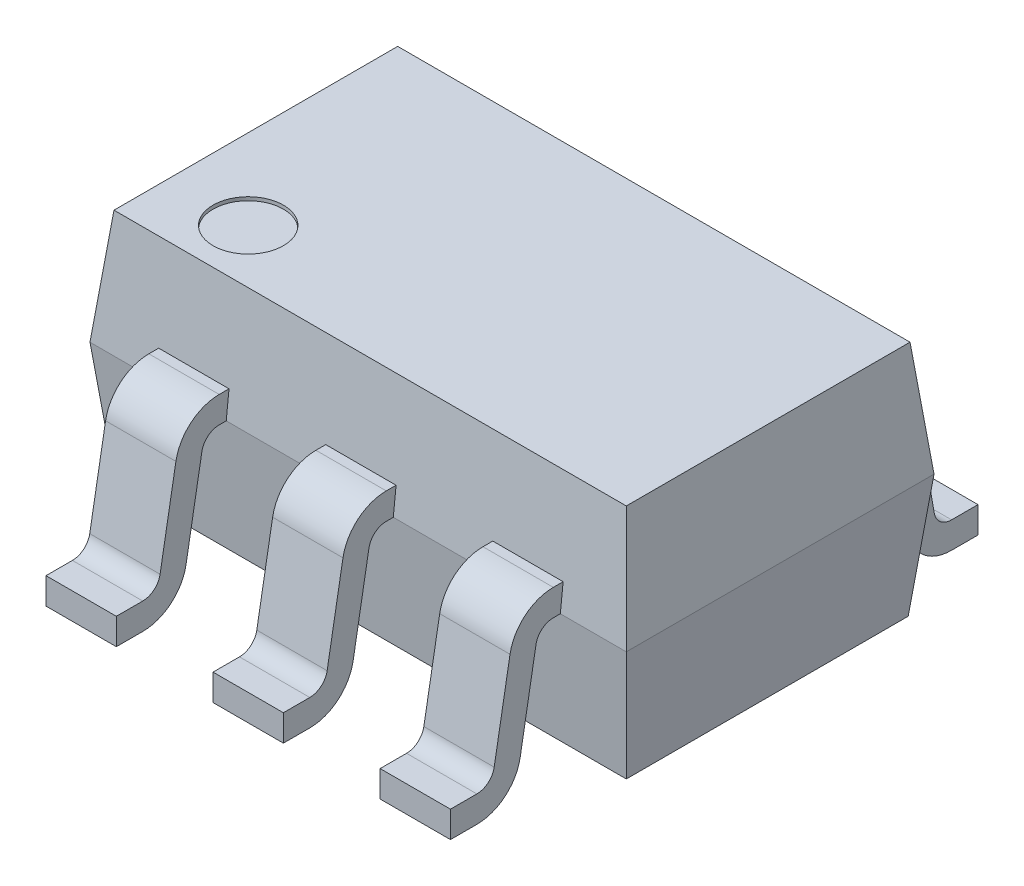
ISO-10303-21;
HEADER;
FILE_DESCRIPTION(('STEP AP214'),'2;1');
FILE_NAME('part.step','',(''),(''),'','','');
FILE_SCHEMA(('AUTOMOTIVE_DESIGN { 1 0 10303 214 1 1 1 1 }'));
ENDSEC;
DATA;
#1=APPLICATION_CONTEXT('core data for automotive mechanical design processes');
#2=APPLICATION_PROTOCOL_DEFINITION('international standard','automotive_design',2000,#1);
#3=PRODUCT_CONTEXT('',#1,'mechanical');
#4=PRODUCT('Part','Part','',(#3));
#5=PRODUCT_RELATED_PRODUCT_CATEGORY('part','',(#4));
#6=PRODUCT_DEFINITION_FORMATION('','',#4);
#7=PRODUCT_DEFINITION_CONTEXT('part definition',#1,'design');
#8=PRODUCT_DEFINITION('design','',#6,#7);
#9=PRODUCT_DEFINITION_SHAPE('','',#8);
#10=(LENGTH_UNIT() NAMED_UNIT(*) SI_UNIT(.MILLI.,.METRE.));
#11=(NAMED_UNIT(*) PLANE_ANGLE_UNIT() SI_UNIT($,.RADIAN.));
#12=(NAMED_UNIT(*) SI_UNIT($,.STERADIAN.) SOLID_ANGLE_UNIT());
#13=UNCERTAINTY_MEASURE_WITH_UNIT(LENGTH_MEASURE(1.E-05),#10,'distance_accuracy_value','');
#14=(GEOMETRIC_REPRESENTATION_CONTEXT(3) GLOBAL_UNCERTAINTY_ASSIGNED_CONTEXT((#13)) GLOBAL_UNIT_ASSIGNED_CONTEXT((#10,
#11,#12)) REPRESENTATION_CONTEXT('',''));
#15=CARTESIAN_POINT('',(0.,0.,0.));
#16=DIRECTION('',(0.,0.,1.));
#17=DIRECTION('',(1.,0.,0.));
#18=AXIS2_PLACEMENT_3D('',#15,#16,#17);
#19=CARTESIAN_POINT('',(-1.525,0.8,-0.875000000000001));
#20=DIRECTION('',(0.,0.104528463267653,-0.994521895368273));
#21=DIRECTION('',(0.,0.994521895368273,0.104528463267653));
#22=AXIS2_PLACEMENT_3D('',#19,#20,#21);
#23=PLANE('',#22);
#24=DIRECTION('',(0.,-0.994521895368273,-0.104528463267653));
#25=VECTOR('',#24,1.);
#26=CARTESIAN_POINT('',(0.75,0.8,-0.875000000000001));
#27=LINE('',#26,#25);
#28=CARTESIAN_POINT('',(0.75,0.8,-0.875000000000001));
#29=VERTEX_POINT('',#28);
#30=CARTESIAN_POINT('',(0.75,0.95,-0.859234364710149));
#31=VERTEX_POINT('',#30);
#32=EDGE_CURVE('E704',#29,#31,#27,.F.);
#33=ORIENTED_EDGE('',*,*,#32,.F.);
#34=DIRECTION('',(-1.,0.,0.));
#35=VECTOR('',#34,1.);
#36=CARTESIAN_POINT('',(-1.525,0.8,-0.875000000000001));
#37=LINE('',#36,#35);
#38=CARTESIAN_POINT('',(0.2,0.8,-0.875000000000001));
#39=VERTEX_POINT('',#38);
#40=EDGE_CURVE('E1096',#29,#39,#37,.T.);
#41=ORIENTED_EDGE('',*,*,#40,.T.);
#42=DIRECTION('',(0.,-0.994521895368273,-0.104528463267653));
#43=VECTOR('',#42,1.);
#44=CARTESIAN_POINT('',(0.2,0.8,-0.875000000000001));
#45=LINE('',#44,#43);
#46=CARTESIAN_POINT('',(0.2,0.95,-0.859234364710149));
#47=VERTEX_POINT('',#46);
#48=EDGE_CURVE('E1017',#39,#47,#45,.F.);
#49=ORIENTED_EDGE('',*,*,#48,.T.);
#50=DIRECTION('',(1.,0.,0.));
#51=VECTOR('',#50,1.);
#52=CARTESIAN_POINT('',(-1.525,0.95,-0.859234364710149));
#53=LINE('',#52,#51);
#54=CARTESIAN_POINT('',(-0.2,0.95,-0.859234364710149));
#55=VERTEX_POINT('',#54);
#56=EDGE_CURVE('E1064',#47,#55,#53,.F.);
#57=ORIENTED_EDGE('',*,*,#56,.T.);
#58=DIRECTION('',(0.,-0.994521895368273,-0.104528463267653));
#59=VECTOR('',#58,1.);
#60=CARTESIAN_POINT('',(-0.2,0.8,-0.875000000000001));
#61=LINE('',#60,#59);
#62=CARTESIAN_POINT('',(-0.2,0.8,-0.875000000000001));
#63=VERTEX_POINT('',#62);
#64=EDGE_CURVE('E1059',#63,#55,#61,.F.);
#65=ORIENTED_EDGE('',*,*,#64,.F.);
#66=CARTESIAN_POINT('',(-0.75,0.8,-0.875000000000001));
#67=VERTEX_POINT('',#66);
#68=EDGE_CURVE('E1097',#63,#67,#37,.T.);
#69=ORIENTED_EDGE('',*,*,#68,.T.);
#70=DIRECTION('',(0.,-0.994521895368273,-0.104528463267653));
#71=VECTOR('',#70,1.);
#72=CARTESIAN_POINT('',(-0.75,0.8,-0.875000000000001));
#73=LINE('',#72,#71);
#74=CARTESIAN_POINT('',(-0.75,0.95,-0.859234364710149));
#75=VERTEX_POINT('',#74);
#76=EDGE_CURVE('E879',#67,#75,#73,.F.);
#77=ORIENTED_EDGE('',*,*,#76,.T.);
#78=DIRECTION('',(1.,0.,0.));
#79=VECTOR('',#78,1.);
#80=CARTESIAN_POINT('',(-1.525,0.95,-0.859234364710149));
#81=LINE('',#80,#79);
#82=CARTESIAN_POINT('',(-1.15,0.95,-0.859234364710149));
#83=VERTEX_POINT('',#82);
#84=EDGE_CURVE('E890',#75,#83,#81,.F.);
#85=ORIENTED_EDGE('',*,*,#84,.T.);
#86=DIRECTION('',(0.,-0.994521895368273,-0.104528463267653));
#87=VECTOR('',#86,1.);
#88=CARTESIAN_POINT('',(-1.15,0.8,-0.875000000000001));
#89=LINE('',#88,#87);
#90=CARTESIAN_POINT('',(-1.15,0.8,-0.875000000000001));
#91=VERTEX_POINT('',#90);
#92=EDGE_CURVE('E884',#91,#83,#89,.F.);
#93=ORIENTED_EDGE('',*,*,#92,.F.);
#94=CARTESIAN_POINT('',(-1.525,0.8,-0.875000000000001));
#95=VERTEX_POINT('',#94);
#96=EDGE_CURVE('E1091',#91,#95,#37,.T.);
#97=ORIENTED_EDGE('',*,*,#96,.T.);
#98=DIRECTION('',(-0.103962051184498,-0.989132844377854,-0.103962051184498));
#99=VECTOR('',#98,1.);
#100=CARTESIAN_POINT('',(-1.50608581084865,0.979956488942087,-0.856085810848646));
#101=LINE('',#100,#99);
#102=CARTESIAN_POINT('',(-1.45668224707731,1.45,-0.806682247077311));
#103=VERTEX_POINT('',#102);
#104=EDGE_CURVE('E1072',#103,#95,#101,.T.);
#105=ORIENTED_EDGE('',*,*,#104,.F.);
#106=DIRECTION('',(1.,0.,0.));
#107=VECTOR('',#106,1.);
#108=CARTESIAN_POINT('',(1.525,1.45,-0.806682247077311));
#109=LINE('',#108,#107);
#110=CARTESIAN_POINT('',(1.45668224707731,1.45,-0.806682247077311));
#111=VERTEX_POINT('',#110);
#112=EDGE_CURVE('E1084',#111,#103,#109,.F.);
#113=ORIENTED_EDGE('',*,*,#112,.F.);
#114=DIRECTION('',(0.103962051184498,-0.989132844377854,-0.103962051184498));
#115=VECTOR('',#114,1.);
#116=CARTESIAN_POINT('',(1.49203527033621,1.11363845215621,-0.842035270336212));
#117=LINE('',#116,#115);
#118=CARTESIAN_POINT('',(1.525,0.8,-0.875000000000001));
#119=VERTEX_POINT('',#118);
#120=EDGE_CURVE('E1068',#111,#119,#117,.T.);
#121=ORIENTED_EDGE('',*,*,#120,.T.);
#122=CARTESIAN_POINT('',(1.15,0.8,-0.875000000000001));
#123=VERTEX_POINT('',#122);
#124=EDGE_CURVE('E1092',#119,#123,#37,.T.);
#125=ORIENTED_EDGE('',*,*,#124,.T.);
#126=DIRECTION('',(0.,-0.994521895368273,-0.104528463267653));
#127=VECTOR('',#126,1.);
#128=CARTESIAN_POINT('',(1.15,0.8,-0.875000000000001));
#129=LINE('',#128,#127);
#130=CARTESIAN_POINT('',(1.15,0.95,-0.859234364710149));
#131=VERTEX_POINT('',#130);
#132=EDGE_CURVE('E51',#123,#131,#129,.F.);
#133=ORIENTED_EDGE('',*,*,#132,.T.);
#134=DIRECTION('',(1.,0.,0.));
#135=VECTOR('',#134,1.);
#136=CARTESIAN_POINT('',(-1.525,0.95,-0.859234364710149));
#137=LINE('',#136,#135);
#138=EDGE_CURVE('E46',#131,#31,#137,.F.);
#139=ORIENTED_EDGE('',*,*,#138,.T.);
#140=EDGE_LOOP('',(#33,#41,#49,#57,#65,#69,#77,#85,#93,#97,#105,#113,#121,#125,#133,#139));
#141=FACE_BOUND('',#140,.T.);
#142=ADVANCED_FACE('F31',(#141),#23,.T.);
#143=CARTESIAN_POINT('',(-1.525,0.8,0.875000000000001));
#144=DIRECTION('',(0.,0.104528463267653,0.994521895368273));
#145=DIRECTION('',(0.,-0.994521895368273,0.104528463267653));
#146=AXIS2_PLACEMENT_3D('',#143,#144,#145);
#147=PLANE('',#146);
#148=DIRECTION('',(0.,0.994521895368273,-0.104528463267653));
#149=VECTOR('',#148,1.);
#150=CARTESIAN_POINT('',(0.75,0.8,0.875000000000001));
#151=LINE('',#150,#149);
#152=CARTESIAN_POINT('',(0.75,0.95,0.859234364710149));
#153=VERTEX_POINT('',#152);
#154=CARTESIAN_POINT('',(0.75,0.8,0.875000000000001));
#155=VERTEX_POINT('',#154);
#156=EDGE_CURVE('E701',#153,#155,#151,.F.);
#157=ORIENTED_EDGE('',*,*,#156,.F.);
#158=DIRECTION('',(-1.,0.,0.));
#159=VECTOR('',#158,1.);
#160=CARTESIAN_POINT('',(-1.525,0.95,0.859234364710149));
#161=LINE('',#160,#159);
#162=CARTESIAN_POINT('',(1.15,0.95,0.859234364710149));
#163=VERTEX_POINT('',#162);
#164=EDGE_CURVE('E11',#153,#163,#161,.F.);
#165=ORIENTED_EDGE('',*,*,#164,.T.);
#166=DIRECTION('',(0.,0.994521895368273,-0.104528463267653));
#167=VECTOR('',#166,1.);
#168=CARTESIAN_POINT('',(1.15,0.8,0.875000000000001));
#169=LINE('',#168,#167);
#170=CARTESIAN_POINT('',(1.15,0.8,0.875000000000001));
#171=VERTEX_POINT('',#170);
#172=EDGE_CURVE('E660',#163,#171,#169,.F.);
#173=ORIENTED_EDGE('',*,*,#172,.T.);
#174=DIRECTION('',(1.,0.,0.));
#175=VECTOR('',#174,1.);
#176=CARTESIAN_POINT('',(-1.525,0.8,0.875000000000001));
#177=LINE('',#176,#175);
#178=CARTESIAN_POINT('',(1.525,0.8,0.875000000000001));
#179=VERTEX_POINT('',#178);
#180=EDGE_CURVE('E1100',#171,#179,#177,.T.);
#181=ORIENTED_EDGE('',*,*,#180,.T.);
#182=DIRECTION('',(0.103962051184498,-0.989132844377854,0.103962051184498));
#183=VECTOR('',#182,1.);
#184=CARTESIAN_POINT('',(1.525,0.8,0.875000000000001));
#185=LINE('',#184,#183);
#186=CARTESIAN_POINT('',(1.45668224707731,1.45,0.806682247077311));
#187=VERTEX_POINT('',#186);
#188=EDGE_CURVE('E1073',#187,#179,#185,.T.);
#189=ORIENTED_EDGE('',*,*,#188,.F.);
#190=DIRECTION('',(-1.,0.,0.));
#191=VECTOR('',#190,1.);
#192=CARTESIAN_POINT('',(1.525,1.45,0.806682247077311));
#193=LINE('',#192,#191);
#194=CARTESIAN_POINT('',(-1.45668224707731,1.45,0.806682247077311));
#195=VERTEX_POINT('',#194);
#196=EDGE_CURVE('E1077',#195,#187,#193,.F.);
#197=ORIENTED_EDGE('',*,*,#196,.F.);
#198=DIRECTION('',(-0.103962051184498,-0.989132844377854,0.103962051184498));
#199=VECTOR('',#198,1.);
#200=CARTESIAN_POINT('',(-1.525,0.8,0.875000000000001));
#201=LINE('',#200,#199);
#202=CARTESIAN_POINT('',(-1.525,0.8,0.875000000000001));
#203=VERTEX_POINT('',#202);
#204=EDGE_CURVE('E1076',#195,#203,#201,.T.);
#205=ORIENTED_EDGE('',*,*,#204,.T.);
#206=CARTESIAN_POINT('',(-1.15,0.8,0.875000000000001));
#207=VERTEX_POINT('',#206);
#208=EDGE_CURVE('E1101',#203,#207,#177,.T.);
#209=ORIENTED_EDGE('',*,*,#208,.T.);
#210=DIRECTION('',(0.,0.994521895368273,-0.104528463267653));
#211=VECTOR('',#210,1.);
#212=CARTESIAN_POINT('',(-1.15,0.8,0.875000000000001));
#213=LINE('',#212,#211);
#214=CARTESIAN_POINT('',(-1.15,0.95,0.859234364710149));
#215=VERTEX_POINT('',#214);
#216=EDGE_CURVE('E881',#215,#207,#213,.F.);
#217=ORIENTED_EDGE('',*,*,#216,.F.);
#218=DIRECTION('',(-1.,0.,0.));
#219=VECTOR('',#218,1.);
#220=CARTESIAN_POINT('',(-1.525,0.95,0.859234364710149));
#221=LINE('',#220,#219);
#222=CARTESIAN_POINT('',(-0.75,0.95,0.859234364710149));
#223=VERTEX_POINT('',#222);
#224=EDGE_CURVE('E39',#215,#223,#221,.F.);
#225=ORIENTED_EDGE('',*,*,#224,.T.);
#226=DIRECTION('',(0.,0.994521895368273,-0.104528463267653));
#227=VECTOR('',#226,1.);
#228=CARTESIAN_POINT('',(-0.75,0.8,0.875000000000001));
#229=LINE('',#228,#227);
#230=CARTESIAN_POINT('',(-0.75,0.8,0.875000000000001));
#231=VERTEX_POINT('',#230);
#232=EDGE_CURVE('E837',#223,#231,#229,.F.);
#233=ORIENTED_EDGE('',*,*,#232,.T.);
#234=CARTESIAN_POINT('',(-0.2,0.8,0.875000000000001));
#235=VERTEX_POINT('',#234);
#236=EDGE_CURVE('E1105',#231,#235,#177,.T.);
#237=ORIENTED_EDGE('',*,*,#236,.T.);
#238=DIRECTION('',(0.,0.994521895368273,-0.104528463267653));
#239=VECTOR('',#238,1.);
#240=CARTESIAN_POINT('',(-0.2,0.8,0.875000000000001));
#241=LINE('',#240,#239);
#242=CARTESIAN_POINT('',(-0.2,0.95,0.859234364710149));
#243=VERTEX_POINT('',#242);
#244=EDGE_CURVE('E1134',#243,#235,#241,.F.);
#245=ORIENTED_EDGE('',*,*,#244,.F.);
#246=DIRECTION('',(-1.,0.,0.));
#247=VECTOR('',#246,1.);
#248=CARTESIAN_POINT('',(-1.525,0.95,0.859234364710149));
#249=LINE('',#248,#247);
#250=CARTESIAN_POINT('',(0.2,0.95,0.859234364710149));
#251=VERTEX_POINT('',#250);
#252=EDGE_CURVE('E1131',#243,#251,#249,.F.);
#253=ORIENTED_EDGE('',*,*,#252,.T.);
#254=DIRECTION('',(0.,0.994521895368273,-0.104528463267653));
#255=VECTOR('',#254,1.);
#256=CARTESIAN_POINT('',(0.2,0.8,0.875000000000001));
#257=LINE('',#256,#255);
#258=CARTESIAN_POINT('',(0.2,0.8,0.875000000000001));
#259=VERTEX_POINT('',#258);
#260=EDGE_CURVE('E1110',#251,#259,#257,.F.);
#261=ORIENTED_EDGE('',*,*,#260,.T.);
#262=EDGE_CURVE('E1254',#259,#155,#177,.T.);
#263=ORIENTED_EDGE('',*,*,#262,.T.);
#264=EDGE_LOOP('',(#157,#165,#173,#181,#189,#197,#205,#209,#217,#225,#233,#237,#245,#253,#261,#263));
#265=FACE_BOUND('',#264,.T.);
#266=ADVANCED_FACE('F1139',(#265),#147,.T.);
#267=CARTESIAN_POINT('',(1.525,0.8,0.875000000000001));
#268=DIRECTION('',(0.994521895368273,-0.104528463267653,0.));
#269=DIRECTION('',(0.104528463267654,0.994521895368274,0.));
#270=AXIS2_PLACEMENT_3D('',#267,#268,#269);
#271=PLANE('',#270);
#272=DIRECTION('',(0.,0.,-1.));
#273=VECTOR('',#272,1.);
#274=CARTESIAN_POINT('',(1.525,0.8,0.875000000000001));
#275=LINE('',#274,#273);
#276=EDGE_CURVE('E1071',#179,#119,#275,.T.);
#277=ORIENTED_EDGE('',*,*,#276,.F.);
#278=DIRECTION('',(0.103962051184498,0.989132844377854,0.103962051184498));
#279=VECTOR('',#278,1.);
#280=CARTESIAN_POINT('',(1.49203527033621,0.486361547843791,0.842035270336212));
#281=LINE('',#280,#279);
#282=CARTESIAN_POINT('',(1.45142703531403,0.1,0.801427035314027));
#283=VERTEX_POINT('',#282);
#284=EDGE_CURVE('E1107',#283,#179,#281,.T.);
#285=ORIENTED_EDGE('',*,*,#284,.F.);
#286=DIRECTION('',(0.,0.,-1.));
#287=VECTOR('',#286,1.);
#288=CARTESIAN_POINT('',(1.45142703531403,0.1,0.875000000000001));
#289=LINE('',#288,#287);
#290=CARTESIAN_POINT('',(1.45142703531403,0.1,-0.801427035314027));
#291=VERTEX_POINT('',#290);
#292=EDGE_CURVE('E1104',#283,#291,#289,.T.);
#293=ORIENTED_EDGE('',*,*,#292,.T.);
#294=DIRECTION('',(0.103962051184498,0.989132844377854,-0.103962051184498));
#295=VECTOR('',#294,1.);
#296=CARTESIAN_POINT('',(1.50608581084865,0.620043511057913,-0.856085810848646));
#297=LINE('',#296,#295);
#298=EDGE_CURVE('E1112',#291,#119,#297,.T.);
#299=ORIENTED_EDGE('',*,*,#298,.T.);
#300=EDGE_LOOP('',(#277,#285,#293,#299));
#301=FACE_BOUND('',#300,.T.);
#302=ADVANCED_FACE('F1214',(#301),#271,.T.);
#303=CARTESIAN_POINT('',(-1.525,0.8,0.875000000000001));
#304=DIRECTION('',(0.,-0.104528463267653,0.994521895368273));
#305=DIRECTION('',(0.,-0.994521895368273,-0.104528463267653));
#306=AXIS2_PLACEMENT_3D('',#303,#304,#305);
#307=PLANE('',#306);
#308=ORIENTED_EDGE('',*,*,#208,.F.);
#309=DIRECTION('',(-0.103962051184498,0.989132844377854,0.103962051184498));
#310=VECTOR('',#309,1.);
#311=CARTESIAN_POINT('',(-1.525,0.8,0.875000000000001));
#312=LINE('',#311,#310);
#313=CARTESIAN_POINT('',(-1.45142703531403,0.1,0.801427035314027));
#314=VERTEX_POINT('',#313);
#315=EDGE_CURVE('E1111',#314,#203,#312,.T.);
#316=ORIENTED_EDGE('',*,*,#315,.F.);
#317=DIRECTION('',(1.,0.,0.));
#318=VECTOR('',#317,1.);
#319=CARTESIAN_POINT('',(-1.525,0.1,0.801427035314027));
#320=LINE('',#319,#318);
#321=EDGE_CURVE('E1115',#314,#283,#320,.T.);
#322=ORIENTED_EDGE('',*,*,#321,.T.);
#323=ORIENTED_EDGE('',*,*,#284,.T.);
#324=ORIENTED_EDGE('',*,*,#180,.F.);
#325=DIRECTION('',(1.,0.,0.));
#326=VECTOR('',#325,1.);
#327=CARTESIAN_POINT('',(-1.525,0.8,0.875000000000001));
#328=LINE('',#327,#326);
#329=EDGE_CURVE('E706',#155,#171,#328,.T.);
#330=ORIENTED_EDGE('',*,*,#329,.F.);
#331=ORIENTED_EDGE('',*,*,#262,.F.);
#332=EDGE_CURVE('E1106',#235,#259,#177,.T.);
#333=ORIENTED_EDGE('',*,*,#332,.F.);
#334=ORIENTED_EDGE('',*,*,#236,.F.);
#335=DIRECTION('',(1.,0.,0.));
#336=VECTOR('',#335,1.);
#337=CARTESIAN_POINT('',(-1.525,0.8,0.875000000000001));
#338=LINE('',#337,#336);
#339=EDGE_CURVE('E887',#207,#231,#338,.T.);
#340=ORIENTED_EDGE('',*,*,#339,.F.);
#341=EDGE_LOOP('',(#308,#316,#322,#323,#324,#330,#331,#333,#334,#340));
#342=FACE_BOUND('',#341,.T.);
#343=ADVANCED_FACE('F33',(#342),#307,.T.);
#344=CARTESIAN_POINT('',(-1.525,0.8,0.875000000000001));
#345=DIRECTION('',(-0.994521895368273,-0.104528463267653,0.));
#346=DIRECTION('',(0.104528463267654,-0.994521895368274,0.));
#347=AXIS2_PLACEMENT_3D('',#344,#345,#346);
#348=PLANE('',#347);
#349=DIRECTION('',(0.,0.,1.));
#350=VECTOR('',#349,1.);
#351=CARTESIAN_POINT('',(-1.525,0.8,0.875000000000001));
#352=LINE('',#351,#350);
#353=EDGE_CURVE('E1094',#95,#203,#352,.T.);
#354=ORIENTED_EDGE('',*,*,#353,.F.);
#355=DIRECTION('',(-0.103962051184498,0.989132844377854,-0.103962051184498));
#356=VECTOR('',#355,1.);
#357=CARTESIAN_POINT('',(-1.525,0.8,-0.875000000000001));
#358=LINE('',#357,#356);
#359=CARTESIAN_POINT('',(-1.45142703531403,0.1,-0.801427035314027));
#360=VERTEX_POINT('',#359);
#361=EDGE_CURVE('E1114',#360,#95,#358,.T.);
#362=ORIENTED_EDGE('',*,*,#361,.F.);
#363=DIRECTION('',(0.,0.,1.));
#364=VECTOR('',#363,1.);
#365=CARTESIAN_POINT('',(-1.45142703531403,0.1,0.875000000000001));
#366=LINE('',#365,#364);
#367=EDGE_CURVE('E1124',#360,#314,#366,.T.);
#368=ORIENTED_EDGE('',*,*,#367,.T.);
#369=ORIENTED_EDGE('',*,*,#315,.T.);
#370=EDGE_LOOP('',(#354,#362,#368,#369));
#371=FACE_BOUND('',#370,.T.);
#372=ADVANCED_FACE('F1229',(#371),#348,.T.);
#373=CARTESIAN_POINT('',(-1.525,0.8,-0.875000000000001));
#374=DIRECTION('',(0.,-0.104528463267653,-0.994521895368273));
#375=DIRECTION('',(0.,0.994521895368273,-0.104528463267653));
#376=AXIS2_PLACEMENT_3D('',#373,#374,#375);
#377=PLANE('',#376);
#378=ORIENTED_EDGE('',*,*,#124,.F.);
#379=ORIENTED_EDGE('',*,*,#298,.F.);
#380=DIRECTION('',(-1.,0.,0.));
#381=VECTOR('',#380,1.);
#382=CARTESIAN_POINT('',(-1.525,0.1,-0.801427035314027));
#383=LINE('',#382,#381);
#384=EDGE_CURVE('E1121',#291,#360,#383,.T.);
#385=ORIENTED_EDGE('',*,*,#384,.T.);
#386=ORIENTED_EDGE('',*,*,#361,.T.);
#387=ORIENTED_EDGE('',*,*,#96,.F.);
#388=EDGE_CURVE('E1243',#67,#91,#37,.T.);
#389=ORIENTED_EDGE('',*,*,#388,.F.);
#390=ORIENTED_EDGE('',*,*,#68,.F.);
#391=DIRECTION('',(-1.,0.,0.));
#392=VECTOR('',#391,1.);
#393=CARTESIAN_POINT('',(-1.525,0.8,-0.875000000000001));
#394=LINE('',#393,#392);
#395=EDGE_CURVE('E1061',#63,#39,#394,.F.);
#396=ORIENTED_EDGE('',*,*,#395,.T.);
#397=ORIENTED_EDGE('',*,*,#40,.F.);
#398=EDGE_CURVE('E1095',#123,#29,#37,.T.);
#399=ORIENTED_EDGE('',*,*,#398,.F.);
#400=EDGE_LOOP('',(#378,#379,#385,#386,#387,#389,#390,#396,#397,#399));
#401=FACE_BOUND('',#400,.T.);
#402=ADVANCED_FACE('F1223',(#401),#377,.T.);
#403=CARTESIAN_POINT('',(1.525,0.1,-0.875000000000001));
#404=DIRECTION('',(0.,-1.,0.));
#405=DIRECTION('',(0.,0.,-1.));
#406=AXIS2_PLACEMENT_3D('',#403,#404,#405);
#407=PLANE('',#406);
#408=ORIENTED_EDGE('',*,*,#292,.F.);
#409=ORIENTED_EDGE('',*,*,#321,.F.);
#410=ORIENTED_EDGE('',*,*,#367,.F.);
#411=ORIENTED_EDGE('',*,*,#384,.F.);
#412=EDGE_LOOP('',(#408,#409,#410,#411));
#413=FACE_BOUND('',#412,.T.);
#414=ADVANCED_FACE('F1219',(#413),#407,.T.);
#415=CARTESIAN_POINT('',(1.525,0.8,0.875000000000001));
#416=DIRECTION('',(0.994521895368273,0.104528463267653,0.));
#417=DIRECTION('',(-0.104528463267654,0.994521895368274,0.));
#418=AXIS2_PLACEMENT_3D('',#415,#416,#417);
#419=PLANE('',#418);
#420=ORIENTED_EDGE('',*,*,#276,.T.);
#421=ORIENTED_EDGE('',*,*,#120,.F.);
#422=DIRECTION('',(0.,0.,1.));
#423=VECTOR('',#422,1.);
#424=CARTESIAN_POINT('',(1.45668224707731,1.45,-0.875000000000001));
#425=LINE('',#424,#423);
#426=EDGE_CURVE('E1067',#187,#111,#425,.F.);
#427=ORIENTED_EDGE('',*,*,#426,.F.);
#428=ORIENTED_EDGE('',*,*,#188,.T.);
#429=EDGE_LOOP('',(#420,#421,#427,#428));
#430=FACE_BOUND('',#429,.T.);
#431=ADVANCED_FACE('F1222',(#430),#419,.T.);
#432=CARTESIAN_POINT('',(-1.525,0.8,0.875000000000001));
#433=DIRECTION('',(-0.994521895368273,0.104528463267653,0.));
#434=DIRECTION('',(-0.104528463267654,-0.994521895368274,0.));
#435=AXIS2_PLACEMENT_3D('',#432,#433,#434);
#436=PLANE('',#435);
#437=ORIENTED_EDGE('',*,*,#353,.T.);
#438=ORIENTED_EDGE('',*,*,#204,.F.);
#439=DIRECTION('',(0.,0.,-1.));
#440=VECTOR('',#439,1.);
#441=CARTESIAN_POINT('',(-1.45668224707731,1.45,-0.875000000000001));
#442=LINE('',#441,#440);
#443=EDGE_CURVE('E1086',#103,#195,#442,.F.);
#444=ORIENTED_EDGE('',*,*,#443,.F.);
#445=ORIENTED_EDGE('',*,*,#104,.T.);
#446=EDGE_LOOP('',(#437,#438,#444,#445));
#447=FACE_BOUND('',#446,.T.);
#448=ADVANCED_FACE('F1218',(#447),#436,.T.);
#449=CARTESIAN_POINT('',(1.525,1.45,-0.875000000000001));
#450=DIRECTION('',(0.,-1.,0.));
#451=DIRECTION('',(0.,0.,-1.));
#452=AXIS2_PLACEMENT_3D('',#449,#450,#451);
#453=PLANE('',#452);
#454=CARTESIAN_POINT('',(-1.,1.45,0.5));
#455=DIRECTION('',(0.,1.,0.));
#456=DIRECTION('',(0.,0.,1.));
#457=AXIS2_PLACEMENT_3D('',#454,#455,#456);
#458=CIRCLE('',#457,0.2);
#459=CARTESIAN_POINT('',(-1.,1.45,0.7));
#460=VERTEX_POINT('',#459);
#461=EDGE_CURVE('E548',#460,#460,#458,.T.);
#462=ORIENTED_EDGE('',*,*,#461,.F.);
#463=EDGE_LOOP('',(#462));
#464=FACE_BOUND('',#463,.T.);
#465=ORIENTED_EDGE('',*,*,#426,.T.);
#466=ORIENTED_EDGE('',*,*,#112,.T.);
#467=ORIENTED_EDGE('',*,*,#443,.T.);
#468=ORIENTED_EDGE('',*,*,#196,.T.);
#469=EDGE_LOOP('',(#465,#466,#467,#468));
#470=FACE_BOUND('',#469,.T.);
#471=ADVANCED_FACE('F1533',(#464,#470),#453,.F.);
#472=CARTESIAN_POINT('',(-0.2,0.7,0.915028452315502));
#473=DIRECTION('',(1.,0.,0.));
#474=DIRECTION('',(0.,0.,-1.));
#475=AXIS2_PLACEMENT_3D('',#472,#473,#474);
#476=CYLINDRICAL_SURFACE('',#475,0.0999999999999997);
#477=CARTESIAN_POINT('',(0.2,0.7,0.915028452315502));
#478=DIRECTION('',(-1.,0.,0.));
#479=DIRECTION('',(0.,0.,1.));
#480=AXIS2_PLACEMENT_3D('',#477,#478,#479);
#481=CIRCLE('',#480,0.0999999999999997);
#482=CARTESIAN_POINT('',(0.2,0.717364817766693,1.01350922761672));
#483=VERTEX_POINT('',#482);
#484=CARTESIAN_POINT('',(0.2,0.8,0.915028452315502));
#485=VERTEX_POINT('',#484);
#486=EDGE_CURVE('E968',#483,#485,#481,.T.);
#487=ORIENTED_EDGE('',*,*,#486,.F.);
#488=DIRECTION('',(1.,0.,0.));
#489=VECTOR('',#488,1.);
#490=CARTESIAN_POINT('',(-0.2,0.717364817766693,1.01350922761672));
#491=LINE('',#490,#489);
#492=CARTESIAN_POINT('',(-0.2,0.717364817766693,1.01350922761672));
#493=VERTEX_POINT('',#492);
#494=EDGE_CURVE('E1050',#493,#483,#491,.T.);
#495=ORIENTED_EDGE('',*,*,#494,.F.);
#496=CARTESIAN_POINT('',(-0.2,0.7,0.915028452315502));
#497=DIRECTION('',(-1.,0.,0.));
#498=DIRECTION('',(0.,0.,1.));
#499=AXIS2_PLACEMENT_3D('',#496,#497,#498);
#500=CIRCLE('',#499,0.0999999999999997);
#501=CARTESIAN_POINT('',(-0.2,0.8,0.915028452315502));
#502=VERTEX_POINT('',#501);
#503=EDGE_CURVE('E906',#493,#502,#500,.T.);
#504=ORIENTED_EDGE('',*,*,#503,.T.);
#505=DIRECTION('',(1.,0.,0.));
#506=VECTOR('',#505,1.);
#507=CARTESIAN_POINT('',(-0.2,0.8,0.915028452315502));
#508=LINE('',#507,#506);
#509=EDGE_CURVE('E1048',#502,#485,#508,.T.);
#510=ORIENTED_EDGE('',*,*,#509,.T.);
#511=EDGE_LOOP('',(#487,#495,#504,#510));
#512=FACE_BOUND('',#511,.T.);
#513=ADVANCED_FACE('F1529',(#512),#476,.F.);
#514=CARTESIAN_POINT('',(-0.2,0.206587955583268,1.10357296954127));
#515=DIRECTION('',(0.,-0.173648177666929,-0.984807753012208));
#516=DIRECTION('',(0.,0.984807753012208,-0.173648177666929));
#517=AXIS2_PLACEMENT_3D('',#514,#515,#516);
#518=PLANE('',#517);
#519=DIRECTION('',(0.,0.984807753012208,-0.173648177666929));
#520=VECTOR('',#519,1.);
#521=CARTESIAN_POINT('',(0.2,0.206587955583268,1.10357296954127));
#522=LINE('',#521,#520);
#523=CARTESIAN_POINT('',(0.2,0.206587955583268,1.10357296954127));
#524=VERTEX_POINT('',#523);
#525=EDGE_CURVE('E965',#524,#483,#522,.T.);
#526=ORIENTED_EDGE('',*,*,#525,.F.);
#527=DIRECTION('',(1.,0.,0.));
#528=VECTOR('',#527,1.);
#529=CARTESIAN_POINT('',(-0.2,0.206587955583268,1.10357296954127));
#530=LINE('',#529,#528);
#531=CARTESIAN_POINT('',(-0.2,0.206587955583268,1.10357296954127));
#532=VERTEX_POINT('',#531);
#533=EDGE_CURVE('E1052',#532,#524,#530,.T.);
#534=ORIENTED_EDGE('',*,*,#533,.F.);
#535=DIRECTION('',(0.,0.984807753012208,-0.173648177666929));
#536=VECTOR('',#535,1.);
#537=CARTESIAN_POINT('',(-0.2,0.206587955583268,1.10357296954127));
#538=LINE('',#537,#536);
#539=EDGE_CURVE('E903',#532,#493,#538,.T.);
#540=ORIENTED_EDGE('',*,*,#539,.T.);
#541=ORIENTED_EDGE('',*,*,#494,.T.);
#542=EDGE_LOOP('',(#526,#534,#540,#541));
#543=FACE_BOUND('',#542,.T.);
#544=ADVANCED_FACE('F1532',(#543),#518,.T.);
#545=CARTESIAN_POINT('',(-0.2,0.25,1.34977490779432));
#546=DIRECTION('',(1.,0.,0.));
#547=DIRECTION('',(0.,0.,-1.));
#548=AXIS2_PLACEMENT_3D('',#545,#546,#547);
#549=CYLINDRICAL_SURFACE('',#548,0.25);
#550=CARTESIAN_POINT('',(0.2,0.25,1.34977490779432));
#551=DIRECTION('',(1.,0.,0.));
#552=DIRECTION('',(0.,0.,-1.));
#553=AXIS2_PLACEMENT_3D('',#550,#551,#552);
#554=CIRCLE('',#553,0.25);
#555=CARTESIAN_POINT('',(0.2,0.,1.34977490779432));
#556=VERTEX_POINT('',#555);
#557=EDGE_CURVE('E962',#556,#524,#554,.T.);
#558=ORIENTED_EDGE('',*,*,#557,.F.);
#559=DIRECTION('',(1.,0.,0.));
#560=VECTOR('',#559,1.);
#561=CARTESIAN_POINT('',(-0.2,0.,1.34977490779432));
#562=LINE('',#561,#560);
#563=CARTESIAN_POINT('',(-0.2,0.,1.34977490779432));
#564=VERTEX_POINT('',#563);
#565=EDGE_CURVE('E1054',#564,#556,#562,.T.);
#566=ORIENTED_EDGE('',*,*,#565,.F.);
#567=CARTESIAN_POINT('',(-0.2,0.25,1.34977490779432));
#568=DIRECTION('',(1.,0.,0.));
#569=DIRECTION('',(0.,0.,-1.));
#570=AXIS2_PLACEMENT_3D('',#567,#568,#569);
#571=CIRCLE('',#570,0.25);
#572=EDGE_CURVE('E900',#564,#532,#571,.T.);
#573=ORIENTED_EDGE('',*,*,#572,.T.);
#574=ORIENTED_EDGE('',*,*,#533,.T.);
#575=EDGE_LOOP('',(#558,#566,#573,#574));
#576=FACE_BOUND('',#575,.T.);
#577=ADVANCED_FACE('F1537',(#576),#549,.T.);
#578=CARTESIAN_POINT('',(-0.2,0.,1.5));
#579=DIRECTION('',(0.,-1.,0.));
#580=DIRECTION('',(0.,0.,-1.));
#581=AXIS2_PLACEMENT_3D('',#578,#579,#580);
#582=PLANE('',#581);
#583=DIRECTION('',(0.,0.,-1.));
#584=VECTOR('',#583,1.);
#585=CARTESIAN_POINT('',(0.2,0.,1.5));
#586=LINE('',#585,#584);
#587=CARTESIAN_POINT('',(0.2,0.,1.5));
#588=VERTEX_POINT('',#587);
#589=EDGE_CURVE('E959',#588,#556,#586,.T.);
#590=ORIENTED_EDGE('',*,*,#589,.F.);
#591=DIRECTION('',(1.,0.,0.));
#592=VECTOR('',#591,1.);
#593=CARTESIAN_POINT('',(-0.2,0.,1.5));
#594=LINE('',#593,#592);
#595=CARTESIAN_POINT('',(-0.2,0.,1.5));
#596=VERTEX_POINT('',#595);
#597=EDGE_CURVE('E956',#596,#588,#594,.T.);
#598=ORIENTED_EDGE('',*,*,#597,.F.);
#599=DIRECTION('',(0.,0.,-1.));
#600=VECTOR('',#599,1.);
#601=CARTESIAN_POINT('',(-0.2,0.,1.5));
#602=LINE('',#601,#600);
#603=EDGE_CURVE('E896',#596,#564,#602,.T.);
#604=ORIENTED_EDGE('',*,*,#603,.T.);
#605=ORIENTED_EDGE('',*,*,#565,.T.);
#606=EDGE_LOOP('',(#590,#598,#604,#605));
#607=FACE_BOUND('',#606,.T.);
#608=ADVANCED_FACE('F1541',(#607),#582,.T.);
#609=CARTESIAN_POINT('',(-0.2,0.,1.5));
#610=DIRECTION('',(0.,0.,1.));
#611=DIRECTION('',(1.,0.,0.));
#612=AXIS2_PLACEMENT_3D('',#609,#610,#611);
#613=PLANE('',#612);
#614=DIRECTION('',(0.,-1.,0.));
#615=VECTOR('',#614,1.);
#616=CARTESIAN_POINT('',(0.2,0.,1.5));
#617=LINE('',#616,#615);
#618=CARTESIAN_POINT('',(0.2,0.15,1.5));
#619=VERTEX_POINT('',#618);
#620=EDGE_CURVE('E892',#619,#588,#617,.T.);
#621=ORIENTED_EDGE('',*,*,#620,.F.);
#622=DIRECTION('',(1.,0.,0.));
#623=VECTOR('',#622,1.);
#624=CARTESIAN_POINT('',(-0.2,0.15,1.5));
#625=LINE('',#624,#623);
#626=CARTESIAN_POINT('',(-0.2,0.15,1.5));
#627=VERTEX_POINT('',#626);
#628=EDGE_CURVE('E1015',#627,#619,#625,.T.);
#629=ORIENTED_EDGE('',*,*,#628,.F.);
#630=DIRECTION('',(0.,-1.,0.));
#631=VECTOR('',#630,1.);
#632=CARTESIAN_POINT('',(-0.2,0.,1.5));
#633=LINE('',#632,#631);
#634=EDGE_CURVE('E893',#627,#596,#633,.T.);
#635=ORIENTED_EDGE('',*,*,#634,.T.);
#636=ORIENTED_EDGE('',*,*,#597,.T.);
#637=EDGE_LOOP('',(#621,#629,#635,#636));
#638=FACE_BOUND('',#637,.T.);
#639=ADVANCED_FACE('F1475',(#638),#613,.T.);
#640=CARTESIAN_POINT('',(-0.2,0.15,1.5));
#641=DIRECTION('',(0.,1.,0.));
#642=DIRECTION('',(0.,0.,1.));
#643=AXIS2_PLACEMENT_3D('',#640,#641,#642);
#644=PLANE('',#643);
#645=DIRECTION('',(0.,0.,1.));
#646=VECTOR('',#645,1.);
#647=CARTESIAN_POINT('',(0.2,0.15,1.5));
#648=LINE('',#647,#646);
#649=CARTESIAN_POINT('',(0.2,0.15,1.34977490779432));
#650=VERTEX_POINT('',#649);
#651=EDGE_CURVE('E897',#650,#619,#648,.T.);
#652=ORIENTED_EDGE('',*,*,#651,.F.);
#653=DIRECTION('',(1.,0.,0.));
#654=VECTOR('',#653,1.);
#655=CARTESIAN_POINT('',(-0.2,0.15,1.34977490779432));
#656=LINE('',#655,#654);
#657=CARTESIAN_POINT('',(-0.2,0.15,1.34977490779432));
#658=VERTEX_POINT('',#657);
#659=EDGE_CURVE('E1018',#658,#650,#656,.T.);
#660=ORIENTED_EDGE('',*,*,#659,.F.);
#661=DIRECTION('',(0.,0.,1.));
#662=VECTOR('',#661,1.);
#663=CARTESIAN_POINT('',(-0.2,0.15,1.5));
#664=LINE('',#663,#662);
#665=EDGE_CURVE('E953',#658,#627,#664,.T.);
#666=ORIENTED_EDGE('',*,*,#665,.T.);
#667=ORIENTED_EDGE('',*,*,#628,.T.);
#668=EDGE_LOOP('',(#652,#660,#666,#667));
#669=FACE_BOUND('',#668,.T.);
#670=ADVANCED_FACE('F1471',(#669),#644,.T.);
#671=CARTESIAN_POINT('',(-0.2,0.25,1.34977490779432));
#672=DIRECTION('',(1.,0.,0.));
#673=DIRECTION('',(0.,0.,-1.));
#674=AXIS2_PLACEMENT_3D('',#671,#672,#673);
#675=CYLINDRICAL_SURFACE('',#674,0.1);
#676=CARTESIAN_POINT('',(0.2,0.25,1.34977490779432));
#677=DIRECTION('',(-1.,0.,0.));
#678=DIRECTION('',(0.,0.,-1.));
#679=AXIS2_PLACEMENT_3D('',#676,#677,#678);
#680=CIRCLE('',#679,0.1);
#681=CARTESIAN_POINT('',(0.2,0.232635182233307,1.2512941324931));
#682=VERTEX_POINT('',#681);
#683=EDGE_CURVE('E1010',#682,#650,#680,.T.);
#684=ORIENTED_EDGE('',*,*,#683,.F.);
#685=DIRECTION('',(1.,0.,0.));
#686=VECTOR('',#685,1.);
#687=CARTESIAN_POINT('',(-0.2,0.232635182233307,1.2512941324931));
#688=LINE('',#687,#686);
#689=CARTESIAN_POINT('',(-0.2,0.232635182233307,1.2512941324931));
#690=VERTEX_POINT('',#689);
#691=EDGE_CURVE('E1020',#690,#682,#688,.T.);
#692=ORIENTED_EDGE('',*,*,#691,.F.);
#693=CARTESIAN_POINT('',(-0.2,0.25,1.34977490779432));
#694=DIRECTION('',(-1.,0.,0.));
#695=DIRECTION('',(0.,0.,-1.));
#696=AXIS2_PLACEMENT_3D('',#693,#694,#695);
#697=CIRCLE('',#696,0.1);
#698=EDGE_CURVE('E950',#690,#658,#697,.T.);
#699=ORIENTED_EDGE('',*,*,#698,.T.);
#700=ORIENTED_EDGE('',*,*,#659,.T.);
#701=EDGE_LOOP('',(#684,#692,#699,#700));
#702=FACE_BOUND('',#701,.T.);
#703=ADVANCED_FACE('F1474',(#702),#675,.F.);
#704=CARTESIAN_POINT('',(-0.2,0.232635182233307,1.2512941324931));
#705=DIRECTION('',(0.,0.173648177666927,0.984807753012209));
#706=DIRECTION('',(0.,-0.984807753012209,0.173648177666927));
#707=AXIS2_PLACEMENT_3D('',#704,#705,#706);
#708=PLANE('',#707);
#709=DIRECTION('',(0.,-0.984807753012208,0.173648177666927));
#710=VECTOR('',#709,1.);
#711=CARTESIAN_POINT('',(0.2,0.232635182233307,1.2512941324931));
#712=LINE('',#711,#710);
#713=CARTESIAN_POINT('',(0.2,0.743412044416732,1.16123039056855));
#714=VERTEX_POINT('',#713);
#715=EDGE_CURVE('E1007',#714,#682,#712,.T.);
#716=ORIENTED_EDGE('',*,*,#715,.F.);
#717=DIRECTION('',(1.,0.,0.));
#718=VECTOR('',#717,1.);
#719=CARTESIAN_POINT('',(-0.2,0.743412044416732,1.16123039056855));
#720=LINE('',#719,#718);
#721=CARTESIAN_POINT('',(-0.2,0.743412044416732,1.16123039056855));
#722=VERTEX_POINT('',#721);
#723=EDGE_CURVE('E1022',#722,#714,#720,.T.);
#724=ORIENTED_EDGE('',*,*,#723,.F.);
#725=DIRECTION('',(0.,-0.984807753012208,0.173648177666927));
#726=VECTOR('',#725,1.);
#727=CARTESIAN_POINT('',(-0.2,0.232635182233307,1.2512941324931));
#728=LINE('',#727,#726);
#729=EDGE_CURVE('E947',#722,#690,#728,.T.);
#730=ORIENTED_EDGE('',*,*,#729,.T.);
#731=ORIENTED_EDGE('',*,*,#691,.T.);
#732=EDGE_LOOP('',(#716,#724,#730,#731));
#733=FACE_BOUND('',#732,.T.);
#734=ADVANCED_FACE('F1479',(#733),#708,.T.);
#735=CARTESIAN_POINT('',(-0.2,0.7,0.915028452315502));
#736=DIRECTION('',(1.,0.,0.));
#737=DIRECTION('',(0.,0.,-1.));
#738=AXIS2_PLACEMENT_3D('',#735,#736,#737);
#739=CYLINDRICAL_SURFACE('',#738,0.25);
#740=CARTESIAN_POINT('',(0.2,0.7,0.915028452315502));
#741=DIRECTION('',(1.,0.,0.));
#742=DIRECTION('',(0.,0.,1.));
#743=AXIS2_PLACEMENT_3D('',#740,#741,#742);
#744=CIRCLE('',#743,0.25);
#745=CARTESIAN_POINT('',(0.2,0.95,0.915028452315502));
#746=VERTEX_POINT('',#745);
#747=EDGE_CURVE('E1004',#746,#714,#744,.T.);
#748=ORIENTED_EDGE('',*,*,#747,.F.);
#749=DIRECTION('',(1.,0.,0.));
#750=VECTOR('',#749,1.);
#751=CARTESIAN_POINT('',(-0.2,0.95,0.915028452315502));
#752=LINE('',#751,#750);
#753=CARTESIAN_POINT('',(-0.2,0.95,0.915028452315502));
#754=VERTEX_POINT('',#753);
#755=EDGE_CURVE('E1024',#754,#746,#752,.T.);
#756=ORIENTED_EDGE('',*,*,#755,.F.);
#757=CARTESIAN_POINT('',(-0.2,0.7,0.915028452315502));
#758=DIRECTION('',(1.,0.,0.));
#759=DIRECTION('',(0.,0.,1.));
#760=AXIS2_PLACEMENT_3D('',#757,#758,#759);
#761=CIRCLE('',#760,0.25);
#762=EDGE_CURVE('E944',#754,#722,#761,.T.);
#763=ORIENTED_EDGE('',*,*,#762,.T.);
#764=ORIENTED_EDGE('',*,*,#723,.T.);
#765=EDGE_LOOP('',(#748,#756,#763,#764));
#766=FACE_BOUND('',#765,.T.);
#767=ADVANCED_FACE('F1483',(#766),#739,.T.);
#768=CARTESIAN_POINT('',(-0.2,0.25,1.34977490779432));
#769=DIRECTION('',(1.,0.,0.));
#770=DIRECTION('',(0.,0.,-1.));
#771=AXIS2_PLACEMENT_3D('',#768,#769,#770);
#772=PLANE('',#771);
#773=DIRECTION('',(0.,0.,1.));
#774=VECTOR('',#773,1.);
#775=CARTESIAN_POINT('',(-0.2,0.95,0.915028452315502));
#776=LINE('',#775,#774);
#777=EDGE_CURVE('E940',#243,#754,#776,.T.);
#778=ORIENTED_EDGE('',*,*,#777,.F.);
#779=ORIENTED_EDGE('',*,*,#244,.T.);
#780=DIRECTION('',(0.,0.,-1.));
#781=VECTOR('',#780,1.);
#782=CARTESIAN_POINT('',(-0.2,0.8,0.915028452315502));
#783=LINE('',#782,#781);
#784=EDGE_CURVE('E910',#502,#235,#783,.T.);
#785=ORIENTED_EDGE('',*,*,#784,.F.);
#786=ORIENTED_EDGE('',*,*,#503,.F.);
#787=ORIENTED_EDGE('',*,*,#539,.F.);
#788=ORIENTED_EDGE('',*,*,#572,.F.);
#789=ORIENTED_EDGE('',*,*,#603,.F.);
#790=ORIENTED_EDGE('',*,*,#634,.F.);
#791=ORIENTED_EDGE('',*,*,#665,.F.);
#792=ORIENTED_EDGE('',*,*,#698,.F.);
#793=ORIENTED_EDGE('',*,*,#729,.F.);
#794=ORIENTED_EDGE('',*,*,#762,.F.);
#795=EDGE_LOOP('',(#778,#779,#785,#786,#787,#788,#789,#790,#791,#792,#793,#794));
#796=FACE_BOUND('',#795,.T.);
#797=ADVANCED_FACE('F1466',(#796),#772,.F.);
#798=CARTESIAN_POINT('',(0.2,0.25,1.34977490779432));
#799=DIRECTION('',(1.,0.,0.));
#800=DIRECTION('',(0.,0.,-1.));
#801=AXIS2_PLACEMENT_3D('',#798,#799,#800);
#802=PLANE('',#801);
#803=ORIENTED_EDGE('',*,*,#260,.F.);
#804=DIRECTION('',(0.,0.,1.));
#805=VECTOR('',#804,1.);
#806=CARTESIAN_POINT('',(0.2,0.95,0.915028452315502));
#807=LINE('',#806,#805);
#808=EDGE_CURVE('E1001',#251,#746,#807,.T.);
#809=ORIENTED_EDGE('',*,*,#808,.T.);
#810=ORIENTED_EDGE('',*,*,#747,.T.);
#811=ORIENTED_EDGE('',*,*,#715,.T.);
#812=ORIENTED_EDGE('',*,*,#683,.T.);
#813=ORIENTED_EDGE('',*,*,#651,.T.);
#814=ORIENTED_EDGE('',*,*,#620,.T.);
#815=ORIENTED_EDGE('',*,*,#589,.T.);
#816=ORIENTED_EDGE('',*,*,#557,.T.);
#817=ORIENTED_EDGE('',*,*,#525,.T.);
#818=ORIENTED_EDGE('',*,*,#486,.T.);
#819=DIRECTION('',(0.,0.,-1.));
#820=VECTOR('',#819,1.);
#821=CARTESIAN_POINT('',(0.2,0.8,0.915028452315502));
#822=LINE('',#821,#820);
#823=EDGE_CURVE('E972',#485,#259,#822,.T.);
#824=ORIENTED_EDGE('',*,*,#823,.T.);
#825=EDGE_LOOP('',(#803,#809,#810,#811,#812,#813,#814,#815,#816,#817,#818,#824));
#826=FACE_BOUND('',#825,.T.);
#827=ADVANCED_FACE('F1470',(#826),#802,.T.);
#828=CARTESIAN_POINT('',(-0.2,0.8,0.915028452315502));
#829=DIRECTION('',(0.,-1.,0.));
#830=DIRECTION('',(0.,0.,-1.));
#831=AXIS2_PLACEMENT_3D('',#828,#829,#830);
#832=PLANE('',#831);
#833=ORIENTED_EDGE('',*,*,#332,.T.);
#834=ORIENTED_EDGE('',*,*,#823,.F.);
#835=ORIENTED_EDGE('',*,*,#509,.F.);
#836=ORIENTED_EDGE('',*,*,#784,.T.);
#837=EDGE_LOOP('',(#833,#834,#835,#836));
#838=FACE_BOUND('',#837,.T.);
#839=ADVANCED_FACE('F1260',(#838),#832,.T.);
#840=CARTESIAN_POINT('',(-0.2,0.95,0.915028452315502));
#841=DIRECTION('',(0.,1.,0.));
#842=DIRECTION('',(0.,0.,1.));
#843=AXIS2_PLACEMENT_3D('',#840,#841,#842);
#844=PLANE('',#843);
#845=ORIENTED_EDGE('',*,*,#252,.F.);
#846=ORIENTED_EDGE('',*,*,#777,.T.);
#847=ORIENTED_EDGE('',*,*,#755,.T.);
#848=ORIENTED_EDGE('',*,*,#808,.F.);
#849=EDGE_LOOP('',(#845,#846,#847,#848));
#850=FACE_BOUND('',#849,.T.);
#851=ADVANCED_FACE('F1491',(#850),#844,.T.);
#852=ORIENTED_EDGE('',*,*,#56,.F.);
#853=CARTESIAN_POINT('',(0.2,0.95,-0.915028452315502));
#854=VERTEX_POINT('',#853);
#855=EDGE_CURVE('E1002',#854,#47,#807,.T.);
#856=ORIENTED_EDGE('',*,*,#855,.F.);
#857=DIRECTION('',(1.,0.,0.));
#858=VECTOR('',#857,1.);
#859=CARTESIAN_POINT('',(-0.2,0.95,-0.915028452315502));
#860=LINE('',#859,#858);
#861=CARTESIAN_POINT('',(-0.2,0.95,-0.915028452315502));
#862=VERTEX_POINT('',#861);
#863=EDGE_CURVE('E1027',#862,#854,#860,.T.);
#864=ORIENTED_EDGE('',*,*,#863,.F.);
#865=EDGE_CURVE('E941',#862,#55,#776,.T.);
#866=ORIENTED_EDGE('',*,*,#865,.T.);
#867=EDGE_LOOP('',(#852,#856,#864,#866));
#868=FACE_BOUND('',#867,.T.);
#869=ADVANCED_FACE('F1488',(#868),#844,.T.);
#870=ORIENTED_EDGE('',*,*,#395,.F.);
#871=CARTESIAN_POINT('',(-0.2,0.8,-0.915028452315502));
#872=VERTEX_POINT('',#871);
#873=EDGE_CURVE('E909',#63,#872,#783,.T.);
#874=ORIENTED_EDGE('',*,*,#873,.T.);
#875=DIRECTION('',(1.,0.,0.));
#876=VECTOR('',#875,1.);
#877=CARTESIAN_POINT('',(-0.2,0.8,-0.915028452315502));
#878=LINE('',#877,#876);
#879=CARTESIAN_POINT('',(0.2,0.8,-0.915028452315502));
#880=VERTEX_POINT('',#879);
#881=EDGE_CURVE('E1045',#872,#880,#878,.T.);
#882=ORIENTED_EDGE('',*,*,#881,.T.);
#883=EDGE_CURVE('E971',#39,#880,#822,.T.);
#884=ORIENTED_EDGE('',*,*,#883,.F.);
#885=EDGE_LOOP('',(#870,#874,#882,#884));
#886=FACE_BOUND('',#885,.T.);
#887=ADVANCED_FACE('F1387',(#886),#832,.T.);
#888=ORIENTED_EDGE('',*,*,#873,.F.);
#889=ORIENTED_EDGE('',*,*,#64,.T.);
#890=ORIENTED_EDGE('',*,*,#865,.F.);
#891=CARTESIAN_POINT('',(-0.2,0.7,-0.915028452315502));
#892=DIRECTION('',(1.,0.,0.));
#893=DIRECTION('',(0.,0.,-1.));
#894=AXIS2_PLACEMENT_3D('',#891,#892,#893);
#895=CIRCLE('',#894,0.25);
#896=CARTESIAN_POINT('',(-0.2,0.743412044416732,-1.16123039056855));
#897=VERTEX_POINT('',#896);
#898=EDGE_CURVE('E937',#897,#862,#895,.T.);
#899=ORIENTED_EDGE('',*,*,#898,.F.);
#900=DIRECTION('',(0.,0.984807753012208,0.173648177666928));
#901=VECTOR('',#900,1.);
#902=CARTESIAN_POINT('',(-0.2,0.232635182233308,-1.2512941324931));
#903=LINE('',#902,#901);
#904=CARTESIAN_POINT('',(-0.2,0.232635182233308,-1.2512941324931));
#905=VERTEX_POINT('',#904);
#906=EDGE_CURVE('E934',#905,#897,#903,.T.);
#907=ORIENTED_EDGE('',*,*,#906,.F.);
#908=CARTESIAN_POINT('',(-0.2,0.25,-1.34977490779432));
#909=DIRECTION('',(-1.,0.,0.));
#910=DIRECTION('',(0.,0.,1.));
#911=AXIS2_PLACEMENT_3D('',#908,#909,#910);
#912=CIRCLE('',#911,0.0999999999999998);
#913=CARTESIAN_POINT('',(-0.2,0.15,-1.34977490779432));
#914=VERTEX_POINT('',#913);
#915=EDGE_CURVE('E931',#914,#905,#912,.T.);
#916=ORIENTED_EDGE('',*,*,#915,.F.);
#917=DIRECTION('',(0.,0.,1.));
#918=VECTOR('',#917,1.);
#919=CARTESIAN_POINT('',(-0.2,0.15,-1.5));
#920=LINE('',#919,#918);
#921=CARTESIAN_POINT('',(-0.2,0.15,-1.5));
#922=VERTEX_POINT('',#921);
#923=EDGE_CURVE('E928',#922,#914,#920,.T.);
#924=ORIENTED_EDGE('',*,*,#923,.F.);
#925=DIRECTION('',(0.,1.,0.));
#926=VECTOR('',#925,1.);
#927=CARTESIAN_POINT('',(-0.2,0.,-1.5));
#928=LINE('',#927,#926);
#929=CARTESIAN_POINT('',(-0.2,0.,-1.5));
#930=VERTEX_POINT('',#929);
#931=EDGE_CURVE('E925',#930,#922,#928,.T.);
#932=ORIENTED_EDGE('',*,*,#931,.F.);
#933=DIRECTION('',(0.,0.,-1.));
#934=VECTOR('',#933,1.);
#935=CARTESIAN_POINT('',(-0.2,0.,-1.5));
#936=LINE('',#935,#934);
#937=CARTESIAN_POINT('',(-0.2,0.,-1.34977490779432));
#938=VERTEX_POINT('',#937);
#939=EDGE_CURVE('E922',#938,#930,#936,.T.);
#940=ORIENTED_EDGE('',*,*,#939,.F.);
#941=CARTESIAN_POINT('',(-0.2,0.25,-1.34977490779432));
#942=DIRECTION('',(1.,0.,0.));
#943=DIRECTION('',(0.,0.,1.));
#944=AXIS2_PLACEMENT_3D('',#941,#942,#943);
#945=CIRCLE('',#944,0.25);
#946=CARTESIAN_POINT('',(-0.2,0.206587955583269,-1.10357296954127));
#947=VERTEX_POINT('',#946);
#948=EDGE_CURVE('E919',#947,#938,#945,.T.);
#949=ORIENTED_EDGE('',*,*,#948,.F.);
#950=DIRECTION('',(0.,-0.984807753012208,-0.173648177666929));
#951=VECTOR('',#950,1.);
#952=CARTESIAN_POINT('',(-0.2,0.206587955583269,-1.10357296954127));
#953=LINE('',#952,#951);
#954=CARTESIAN_POINT('',(-0.2,0.717364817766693,-1.01350922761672));
#955=VERTEX_POINT('',#954);
#956=EDGE_CURVE('E916',#955,#947,#953,.T.);
#957=ORIENTED_EDGE('',*,*,#956,.F.);
#958=CARTESIAN_POINT('',(-0.2,0.7,-0.915028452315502));
#959=DIRECTION('',(-1.,0.,0.));
#960=DIRECTION('',(0.,0.,-1.));
#961=AXIS2_PLACEMENT_3D('',#958,#959,#960);
#962=CIRCLE('',#961,0.0999999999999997);
#963=EDGE_CURVE('E913',#872,#955,#962,.T.);
#964=ORIENTED_EDGE('',*,*,#963,.F.);
#965=EDGE_LOOP('',(#888,#889,#890,#899,#907,#916,#924,#932,#940,#949,#957,#964));
#966=FACE_BOUND('',#965,.T.);
#967=ADVANCED_FACE('F1462',(#966),#772,.F.);
#968=ORIENTED_EDGE('',*,*,#48,.F.);
#969=ORIENTED_EDGE('',*,*,#883,.T.);
#970=CARTESIAN_POINT('',(0.2,0.7,-0.915028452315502));
#971=DIRECTION('',(-1.,0.,0.));
#972=DIRECTION('',(0.,0.,-1.));
#973=AXIS2_PLACEMENT_3D('',#970,#971,#972);
#974=CIRCLE('',#973,0.0999999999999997);
#975=CARTESIAN_POINT('',(0.2,0.717364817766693,-1.01350922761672));
#976=VERTEX_POINT('',#975);
#977=EDGE_CURVE('E974',#880,#976,#974,.T.);
#978=ORIENTED_EDGE('',*,*,#977,.T.);
#979=DIRECTION('',(0.,-0.984807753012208,-0.173648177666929));
#980=VECTOR('',#979,1.);
#981=CARTESIAN_POINT('',(0.2,0.206587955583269,-1.10357296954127));
#982=LINE('',#981,#980);
#983=CARTESIAN_POINT('',(0.2,0.206587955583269,-1.10357296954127));
#984=VERTEX_POINT('',#983);
#985=EDGE_CURVE('E977',#976,#984,#982,.T.);
#986=ORIENTED_EDGE('',*,*,#985,.T.);
#987=CARTESIAN_POINT('',(0.2,0.25,-1.34977490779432));
#988=DIRECTION('',(1.,0.,0.));
#989=DIRECTION('',(0.,0.,1.));
#990=AXIS2_PLACEMENT_3D('',#987,#988,#989);
#991=CIRCLE('',#990,0.25);
#992=CARTESIAN_POINT('',(0.2,0.,-1.34977490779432));
#993=VERTEX_POINT('',#992);
#994=EDGE_CURVE('E980',#984,#993,#991,.T.);
#995=ORIENTED_EDGE('',*,*,#994,.T.);
#996=DIRECTION('',(0.,0.,-1.));
#997=VECTOR('',#996,1.);
#998=CARTESIAN_POINT('',(0.2,0.,-1.5));
#999=LINE('',#998,#997);
#1000=CARTESIAN_POINT('',(0.2,0.,-1.5));
#1001=VERTEX_POINT('',#1000);
#1002=EDGE_CURVE('E983',#993,#1001,#999,.T.);
#1003=ORIENTED_EDGE('',*,*,#1002,.T.);
#1004=DIRECTION('',(0.,1.,0.));
#1005=VECTOR('',#1004,1.);
#1006=CARTESIAN_POINT('',(0.2,0.,-1.5));
#1007=LINE('',#1006,#1005);
#1008=CARTESIAN_POINT('',(0.2,0.15,-1.5));
#1009=VERTEX_POINT('',#1008);
#1010=EDGE_CURVE('E986',#1001,#1009,#1007,.T.);
#1011=ORIENTED_EDGE('',*,*,#1010,.T.);
#1012=DIRECTION('',(0.,0.,1.));
#1013=VECTOR('',#1012,1.);
#1014=CARTESIAN_POINT('',(0.2,0.15,-1.5));
#1015=LINE('',#1014,#1013);
#1016=CARTESIAN_POINT('',(0.2,0.15,-1.34977490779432));
#1017=VERTEX_POINT('',#1016);
#1018=EDGE_CURVE('E989',#1009,#1017,#1015,.T.);
#1019=ORIENTED_EDGE('',*,*,#1018,.T.);
#1020=CARTESIAN_POINT('',(0.2,0.25,-1.34977490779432));
#1021=DIRECTION('',(-1.,0.,0.));
#1022=DIRECTION('',(0.,0.,1.));
#1023=AXIS2_PLACEMENT_3D('',#1020,#1021,#1022);
#1024=CIRCLE('',#1023,0.0999999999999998);
#1025=CARTESIAN_POINT('',(0.2,0.232635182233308,-1.2512941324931));
#1026=VERTEX_POINT('',#1025);
#1027=EDGE_CURVE('E992',#1017,#1026,#1024,.T.);
#1028=ORIENTED_EDGE('',*,*,#1027,.T.);
#1029=DIRECTION('',(0.,0.984807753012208,0.173648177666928));
#1030=VECTOR('',#1029,1.);
#1031=CARTESIAN_POINT('',(0.2,0.232635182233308,-1.2512941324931));
#1032=LINE('',#1031,#1030);
#1033=CARTESIAN_POINT('',(0.2,0.743412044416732,-1.16123039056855));
#1034=VERTEX_POINT('',#1033);
#1035=EDGE_CURVE('E995',#1026,#1034,#1032,.T.);
#1036=ORIENTED_EDGE('',*,*,#1035,.T.);
#1037=CARTESIAN_POINT('',(0.2,0.7,-0.915028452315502));
#1038=DIRECTION('',(1.,0.,0.));
#1039=DIRECTION('',(0.,0.,-1.));
#1040=AXIS2_PLACEMENT_3D('',#1037,#1038,#1039);
#1041=CIRCLE('',#1040,0.25);
#1042=EDGE_CURVE('E998',#1034,#854,#1041,.T.);
#1043=ORIENTED_EDGE('',*,*,#1042,.T.);
#1044=ORIENTED_EDGE('',*,*,#855,.T.);
#1045=EDGE_LOOP('',(#968,#969,#978,#986,#995,#1003,#1011,#1019,#1028,#1036,#1043,#1044));
#1046=FACE_BOUND('',#1045,.T.);
#1047=ADVANCED_FACE('F1383',(#1046),#802,.T.);
#1048=CARTESIAN_POINT('',(-0.2,0.7,-0.915028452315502));
#1049=DIRECTION('',(1.,0.,0.));
#1050=DIRECTION('',(0.,0.,-1.));
#1051=AXIS2_PLACEMENT_3D('',#1048,#1049,#1050);
#1052=CYLINDRICAL_SURFACE('',#1051,0.25);
#1053=ORIENTED_EDGE('',*,*,#1042,.F.);
#1054=DIRECTION('',(1.,0.,0.));
#1055=VECTOR('',#1054,1.);
#1056=CARTESIAN_POINT('',(-0.2,0.743412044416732,-1.16123039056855));
#1057=LINE('',#1056,#1055);
#1058=EDGE_CURVE('E1029',#897,#1034,#1057,.T.);
#1059=ORIENTED_EDGE('',*,*,#1058,.F.);
#1060=ORIENTED_EDGE('',*,*,#898,.T.);
#1061=ORIENTED_EDGE('',*,*,#863,.T.);
#1062=EDGE_LOOP('',(#1053,#1059,#1060,#1061));
#1063=FACE_BOUND('',#1062,.T.);
#1064=ADVANCED_FACE('F1469',(#1063),#1052,.T.);
#1065=CARTESIAN_POINT('',(-0.2,0.232635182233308,-1.2512941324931));
#1066=DIRECTION('',(0.,0.173648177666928,-0.984807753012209));
#1067=DIRECTION('',(0.,0.984807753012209,0.173648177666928));
#1068=AXIS2_PLACEMENT_3D('',#1065,#1066,#1067);
#1069=PLANE('',#1068);
#1070=ORIENTED_EDGE('',*,*,#1035,.F.);
#1071=DIRECTION('',(1.,0.,0.));
#1072=VECTOR('',#1071,1.);
#1073=CARTESIAN_POINT('',(-0.2,0.232635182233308,-1.2512941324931));
#1074=LINE('',#1073,#1072);
#1075=EDGE_CURVE('E1031',#905,#1026,#1074,.T.);
#1076=ORIENTED_EDGE('',*,*,#1075,.F.);
#1077=ORIENTED_EDGE('',*,*,#906,.T.);
#1078=ORIENTED_EDGE('',*,*,#1058,.T.);
#1079=EDGE_LOOP('',(#1070,#1076,#1077,#1078));
#1080=FACE_BOUND('',#1079,.T.);
#1081=ADVANCED_FACE('F1495',(#1080),#1069,.T.);
#1082=CARTESIAN_POINT('',(-0.2,0.25,-1.34977490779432));
#1083=DIRECTION('',(1.,0.,0.));
#1084=DIRECTION('',(0.,0.,-1.));
#1085=AXIS2_PLACEMENT_3D('',#1082,#1083,#1084);
#1086=CYLINDRICAL_SURFACE('',#1085,0.0999999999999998);
#1087=ORIENTED_EDGE('',*,*,#1027,.F.);
#1088=DIRECTION('',(1.,0.,0.));
#1089=VECTOR('',#1088,1.);
#1090=CARTESIAN_POINT('',(-0.2,0.15,-1.34977490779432));
#1091=LINE('',#1090,#1089);
#1092=EDGE_CURVE('E1033',#914,#1017,#1091,.T.);
#1093=ORIENTED_EDGE('',*,*,#1092,.F.);
#1094=ORIENTED_EDGE('',*,*,#915,.T.);
#1095=ORIENTED_EDGE('',*,*,#1075,.T.);
#1096=EDGE_LOOP('',(#1087,#1093,#1094,#1095));
#1097=FACE_BOUND('',#1096,.T.);
#1098=ADVANCED_FACE('F1499',(#1097),#1086,.F.);
#1099=CARTESIAN_POINT('',(-0.2,0.15,-1.5));
#1100=DIRECTION('',(0.,1.,0.));
#1101=DIRECTION('',(0.,0.,1.));
#1102=AXIS2_PLACEMENT_3D('',#1099,#1100,#1101);
#1103=PLANE('',#1102);
#1104=ORIENTED_EDGE('',*,*,#1018,.F.);
#1105=DIRECTION('',(1.,0.,0.));
#1106=VECTOR('',#1105,1.);
#1107=CARTESIAN_POINT('',(-0.2,0.15,-1.5));
#1108=LINE('',#1107,#1106);
#1109=EDGE_CURVE('E1035',#922,#1009,#1108,.T.);
#1110=ORIENTED_EDGE('',*,*,#1109,.F.);
#1111=ORIENTED_EDGE('',*,*,#923,.T.);
#1112=ORIENTED_EDGE('',*,*,#1092,.T.);
#1113=EDGE_LOOP('',(#1104,#1110,#1111,#1112));
#1114=FACE_BOUND('',#1113,.T.);
#1115=ADVANCED_FACE('F1503',(#1114),#1103,.T.);
#1116=CARTESIAN_POINT('',(-0.2,0.,-1.5));
#1117=DIRECTION('',(0.,0.,-1.));
#1118=DIRECTION('',(-1.,0.,0.));
#1119=AXIS2_PLACEMENT_3D('',#1116,#1117,#1118);
#1120=PLANE('',#1119);
#1121=ORIENTED_EDGE('',*,*,#1010,.F.);
#1122=DIRECTION('',(1.,0.,0.));
#1123=VECTOR('',#1122,1.);
#1124=CARTESIAN_POINT('',(-0.2,0.,-1.5));
#1125=LINE('',#1124,#1123);
#1126=EDGE_CURVE('E1037',#930,#1001,#1125,.T.);
#1127=ORIENTED_EDGE('',*,*,#1126,.F.);
#1128=ORIENTED_EDGE('',*,*,#931,.T.);
#1129=ORIENTED_EDGE('',*,*,#1109,.T.);
#1130=EDGE_LOOP('',(#1121,#1127,#1128,#1129));
#1131=FACE_BOUND('',#1130,.T.);
#1132=ADVANCED_FACE('F1507',(#1131),#1120,.T.);
#1133=CARTESIAN_POINT('',(-0.2,0.,-1.5));
#1134=DIRECTION('',(0.,-1.,0.));
#1135=DIRECTION('',(0.,0.,-1.));
#1136=AXIS2_PLACEMENT_3D('',#1133,#1134,#1135);
#1137=PLANE('',#1136);
#1138=ORIENTED_EDGE('',*,*,#1002,.F.);
#1139=DIRECTION('',(1.,0.,0.));
#1140=VECTOR('',#1139,1.);
#1141=CARTESIAN_POINT('',(-0.2,0.,-1.34977490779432));
#1142=LINE('',#1141,#1140);
#1143=EDGE_CURVE('E1039',#938,#993,#1142,.T.);
#1144=ORIENTED_EDGE('',*,*,#1143,.F.);
#1145=ORIENTED_EDGE('',*,*,#939,.T.);
#1146=ORIENTED_EDGE('',*,*,#1126,.T.);
#1147=EDGE_LOOP('',(#1138,#1144,#1145,#1146));
#1148=FACE_BOUND('',#1147,.T.);
#1149=ADVANCED_FACE('F1511',(#1148),#1137,.T.);
#1150=CARTESIAN_POINT('',(-0.2,0.25,-1.34977490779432));
#1151=DIRECTION('',(1.,0.,0.));
#1152=DIRECTION('',(0.,0.,-1.));
#1153=AXIS2_PLACEMENT_3D('',#1150,#1151,#1152);
#1154=CYLINDRICAL_SURFACE('',#1153,0.25);
#1155=ORIENTED_EDGE('',*,*,#994,.F.);
#1156=DIRECTION('',(1.,0.,0.));
#1157=VECTOR('',#1156,1.);
#1158=CARTESIAN_POINT('',(-0.2,0.206587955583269,-1.10357296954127));
#1159=LINE('',#1158,#1157);
#1160=EDGE_CURVE('E1041',#947,#984,#1159,.T.);
#1161=ORIENTED_EDGE('',*,*,#1160,.F.);
#1162=ORIENTED_EDGE('',*,*,#948,.T.);
#1163=ORIENTED_EDGE('',*,*,#1143,.T.);
#1164=EDGE_LOOP('',(#1155,#1161,#1162,#1163));
#1165=FACE_BOUND('',#1164,.T.);
#1166=ADVANCED_FACE('F1515',(#1165),#1154,.T.);
#1167=CARTESIAN_POINT('',(-0.2,0.206587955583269,-1.10357296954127));
#1168=DIRECTION('',(0.,-0.173648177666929,0.984807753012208));
#1169=DIRECTION('',(0.,-0.984807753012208,-0.173648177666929));
#1170=AXIS2_PLACEMENT_3D('',#1167,#1168,#1169);
#1171=PLANE('',#1170);
#1172=ORIENTED_EDGE('',*,*,#985,.F.);
#1173=DIRECTION('',(1.,0.,0.));
#1174=VECTOR('',#1173,1.);
#1175=CARTESIAN_POINT('',(-0.2,0.717364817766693,-1.01350922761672));
#1176=LINE('',#1175,#1174);
#1177=EDGE_CURVE('E1043',#955,#976,#1176,.T.);
#1178=ORIENTED_EDGE('',*,*,#1177,.F.);
#1179=ORIENTED_EDGE('',*,*,#956,.T.);
#1180=ORIENTED_EDGE('',*,*,#1160,.T.);
#1181=EDGE_LOOP('',(#1172,#1178,#1179,#1180));
#1182=FACE_BOUND('',#1181,.T.);
#1183=ADVANCED_FACE('F1519',(#1182),#1171,.T.);
#1184=CARTESIAN_POINT('',(-0.2,0.7,-0.915028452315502));
#1185=DIRECTION('',(1.,0.,0.));
#1186=DIRECTION('',(0.,0.,-1.));
#1187=AXIS2_PLACEMENT_3D('',#1184,#1185,#1186);
#1188=CYLINDRICAL_SURFACE('',#1187,0.0999999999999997);
#1189=ORIENTED_EDGE('',*,*,#977,.F.);
#1190=ORIENTED_EDGE('',*,*,#881,.F.);
#1191=ORIENTED_EDGE('',*,*,#963,.T.);
#1192=ORIENTED_EDGE('',*,*,#1177,.T.);
#1193=EDGE_LOOP('',(#1189,#1190,#1191,#1192));
#1194=FACE_BOUND('',#1193,.T.);
#1195=ADVANCED_FACE('F1451',(#1194),#1188,.F.);
#1196=CARTESIAN_POINT('',(-1.15,0.8,0.915028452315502));
#1197=DIRECTION('',(0.,-1.,0.));
#1198=DIRECTION('',(0.,0.,-1.));
#1199=AXIS2_PLACEMENT_3D('',#1196,#1197,#1198);
#1200=PLANE('',#1199);
#1201=DIRECTION('',(0.,0.,-1.));
#1202=VECTOR('',#1201,1.);
#1203=CARTESIAN_POINT('',(-0.75,0.8,0.915028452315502));
#1204=LINE('',#1203,#1202);
#1205=CARTESIAN_POINT('',(-0.75,0.8,-0.915028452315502));
#1206=VERTEX_POINT('',#1205);
#1207=EDGE_CURVE('E789',#67,#1206,#1204,.T.);
#1208=ORIENTED_EDGE('',*,*,#1207,.F.);
#1209=ORIENTED_EDGE('',*,*,#388,.T.);
#1210=DIRECTION('',(0.,0.,-1.));
#1211=VECTOR('',#1210,1.);
#1212=CARTESIAN_POINT('',(-1.15,0.8,0.915028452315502));
#1213=LINE('',#1212,#1211);
#1214=CARTESIAN_POINT('',(-1.15,0.8,-0.915028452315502));
#1215=VERTEX_POINT('',#1214);
#1216=EDGE_CURVE('E727',#91,#1215,#1213,.T.);
#1217=ORIENTED_EDGE('',*,*,#1216,.T.);
#1218=DIRECTION('',(1.,0.,0.));
#1219=VECTOR('',#1218,1.);
#1220=CARTESIAN_POINT('',(-1.15,0.8,-0.915028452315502));
#1221=LINE('',#1220,#1219);
#1222=EDGE_CURVE('E865',#1215,#1206,#1221,.T.);
#1223=ORIENTED_EDGE('',*,*,#1222,.T.);
#1224=EDGE_LOOP('',(#1208,#1209,#1217,#1223));
#1225=FACE_BOUND('',#1224,.T.);
#1226=ADVANCED_FACE('F1204',(#1225),#1200,.T.);
#1227=CARTESIAN_POINT('',(-1.15,0.7,-0.915028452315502));
#1228=DIRECTION('',(1.,0.,0.));
#1229=DIRECTION('',(0.,0.,-1.));
#1230=AXIS2_PLACEMENT_3D('',#1227,#1228,#1229);
#1231=CYLINDRICAL_SURFACE('',#1230,0.0999999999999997);
#1232=CARTESIAN_POINT('',(-0.75,0.7,-0.915028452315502));
#1233=DIRECTION('',(-1.,0.,0.));
#1234=DIRECTION('',(0.,0.,-1.));
#1235=AXIS2_PLACEMENT_3D('',#1232,#1233,#1234);
#1236=CIRCLE('',#1235,0.0999999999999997);
#1237=CARTESIAN_POINT('',(-0.75,0.717364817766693,-1.01350922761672));
#1238=VERTEX_POINT('',#1237);
#1239=EDGE_CURVE('E793',#1206,#1238,#1236,.T.);
#1240=ORIENTED_EDGE('',*,*,#1239,.F.);
#1241=ORIENTED_EDGE('',*,*,#1222,.F.);
#1242=CARTESIAN_POINT('',(-1.15,0.7,-0.915028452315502));
#1243=DIRECTION('',(-1.,0.,0.));
#1244=DIRECTION('',(0.,0.,-1.));
#1245=AXIS2_PLACEMENT_3D('',#1242,#1243,#1244);
#1246=CIRCLE('',#1245,0.0999999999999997);
#1247=CARTESIAN_POINT('',(-1.15,0.717364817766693,-1.01350922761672));
#1248=VERTEX_POINT('',#1247);
#1249=EDGE_CURVE('E731',#1215,#1248,#1246,.T.);
#1250=ORIENTED_EDGE('',*,*,#1249,.T.);
#1251=DIRECTION('',(1.,0.,0.));
#1252=VECTOR('',#1251,1.);
#1253=CARTESIAN_POINT('',(-1.15,0.717364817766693,-1.01350922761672));
#1254=LINE('',#1253,#1252);
#1255=EDGE_CURVE('E863',#1248,#1238,#1254,.T.);
#1256=ORIENTED_EDGE('',*,*,#1255,.T.);
#1257=EDGE_LOOP('',(#1240,#1241,#1250,#1256));
#1258=FACE_BOUND('',#1257,.T.);
#1259=ADVANCED_FACE('F1405',(#1258),#1231,.F.);
#1260=CARTESIAN_POINT('',(-1.15,0.206587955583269,-1.10357296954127));
#1261=DIRECTION('',(0.,-0.173648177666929,0.984807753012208));
#1262=DIRECTION('',(0.,-0.984807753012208,-0.173648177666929));
#1263=AXIS2_PLACEMENT_3D('',#1260,#1261,#1262);
#1264=PLANE('',#1263);
#1265=DIRECTION('',(0.,-0.984807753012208,-0.173648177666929));
#1266=VECTOR('',#1265,1.);
#1267=CARTESIAN_POINT('',(-0.75,0.206587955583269,-1.10357296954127));
#1268=LINE('',#1267,#1266);
#1269=CARTESIAN_POINT('',(-0.75,0.206587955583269,-1.10357296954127));
#1270=VERTEX_POINT('',#1269);
#1271=EDGE_CURVE('E796',#1238,#1270,#1268,.T.);
#1272=ORIENTED_EDGE('',*,*,#1271,.F.);
#1273=ORIENTED_EDGE('',*,*,#1255,.F.);
#1274=DIRECTION('',(0.,-0.984807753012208,-0.173648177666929));
#1275=VECTOR('',#1274,1.);
#1276=CARTESIAN_POINT('',(-1.15,0.206587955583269,-1.10357296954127));
#1277=LINE('',#1276,#1275);
#1278=CARTESIAN_POINT('',(-1.15,0.206587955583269,-1.10357296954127));
#1279=VERTEX_POINT('',#1278);
#1280=EDGE_CURVE('E734',#1248,#1279,#1277,.T.);
#1281=ORIENTED_EDGE('',*,*,#1280,.T.);
#1282=DIRECTION('',(1.,0.,0.));
#1283=VECTOR('',#1282,1.);
#1284=CARTESIAN_POINT('',(-1.15,0.206587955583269,-1.10357296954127));
#1285=LINE('',#1284,#1283);
#1286=EDGE_CURVE('E861',#1279,#1270,#1285,.T.);
#1287=ORIENTED_EDGE('',*,*,#1286,.T.);
#1288=EDGE_LOOP('',(#1272,#1273,#1281,#1287));
#1289=FACE_BOUND('',#1288,.T.);
#1290=ADVANCED_FACE('F1439',(#1289),#1264,.T.);
#1291=CARTESIAN_POINT('',(-1.15,0.25,-1.34977490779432));
#1292=DIRECTION('',(1.,0.,0.));
#1293=DIRECTION('',(0.,0.,-1.));
#1294=AXIS2_PLACEMENT_3D('',#1291,#1292,#1293);
#1295=CYLINDRICAL_SURFACE('',#1294,0.25);
#1296=CARTESIAN_POINT('',(-0.75,0.25,-1.34977490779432));
#1297=DIRECTION('',(1.,0.,0.));
#1298=DIRECTION('',(0.,0.,1.));
#1299=AXIS2_PLACEMENT_3D('',#1296,#1297,#1298);
#1300=CIRCLE('',#1299,0.25);
#1301=CARTESIAN_POINT('',(-0.75,0.,-1.34977490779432));
#1302=VERTEX_POINT('',#1301);
#1303=EDGE_CURVE('E799',#1270,#1302,#1300,.T.);
#1304=ORIENTED_EDGE('',*,*,#1303,.F.);
#1305=ORIENTED_EDGE('',*,*,#1286,.F.);
#1306=CARTESIAN_POINT('',(-1.15,0.25,-1.34977490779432));
#1307=DIRECTION('',(1.,0.,0.));
#1308=DIRECTION('',(0.,0.,1.));
#1309=AXIS2_PLACEMENT_3D('',#1306,#1307,#1308);
#1310=CIRCLE('',#1309,0.25);
#1311=CARTESIAN_POINT('',(-1.15,0.,-1.34977490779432));
#1312=VERTEX_POINT('',#1311);
#1313=EDGE_CURVE('E737',#1279,#1312,#1310,.T.);
#1314=ORIENTED_EDGE('',*,*,#1313,.T.);
#1315=DIRECTION('',(1.,0.,0.));
#1316=VECTOR('',#1315,1.);
#1317=CARTESIAN_POINT('',(-1.15,0.,-1.34977490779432));
#1318=LINE('',#1317,#1316);
#1319=EDGE_CURVE('E859',#1312,#1302,#1318,.T.);
#1320=ORIENTED_EDGE('',*,*,#1319,.T.);
#1321=EDGE_LOOP('',(#1304,#1305,#1314,#1320));
#1322=FACE_BOUND('',#1321,.T.);
#1323=ADVANCED_FACE('F1437',(#1322),#1295,.T.);
#1324=CARTESIAN_POINT('',(-1.15,0.,-1.5));
#1325=DIRECTION('',(0.,-1.,0.));
#1326=DIRECTION('',(0.,0.,-1.));
#1327=AXIS2_PLACEMENT_3D('',#1324,#1325,#1326);
#1328=PLANE('',#1327);
#1329=DIRECTION('',(0.,0.,-1.));
#1330=VECTOR('',#1329,1.);
#1331=CARTESIAN_POINT('',(-0.75,0.,-1.5));
#1332=LINE('',#1331,#1330);
#1333=CARTESIAN_POINT('',(-0.75,0.,-1.5));
#1334=VERTEX_POINT('',#1333);
#1335=EDGE_CURVE('E802',#1302,#1334,#1332,.T.);
#1336=ORIENTED_EDGE('',*,*,#1335,.F.);
#1337=ORIENTED_EDGE('',*,*,#1319,.F.);
#1338=DIRECTION('',(0.,0.,-1.));
#1339=VECTOR('',#1338,1.);
#1340=CARTESIAN_POINT('',(-1.15,0.,-1.5));
#1341=LINE('',#1340,#1339);
#1342=CARTESIAN_POINT('',(-1.15,0.,-1.5));
#1343=VERTEX_POINT('',#1342);
#1344=EDGE_CURVE('E740',#1312,#1343,#1341,.T.);
#1345=ORIENTED_EDGE('',*,*,#1344,.T.);
#1346=DIRECTION('',(1.,0.,0.));
#1347=VECTOR('',#1346,1.);
#1348=CARTESIAN_POINT('',(-1.15,0.,-1.5));
#1349=LINE('',#1348,#1347);
#1350=EDGE_CURVE('E857',#1343,#1334,#1349,.T.);
#1351=ORIENTED_EDGE('',*,*,#1350,.T.);
#1352=EDGE_LOOP('',(#1336,#1337,#1345,#1351));
#1353=FACE_BOUND('',#1352,.T.);
#1354=ADVANCED_FACE('F1434',(#1353),#1328,.T.);
#1355=CARTESIAN_POINT('',(-1.15,0.,-1.5));
#1356=DIRECTION('',(0.,0.,-1.));
#1357=DIRECTION('',(-1.,0.,0.));
#1358=AXIS2_PLACEMENT_3D('',#1355,#1356,#1357);
#1359=PLANE('',#1358);
#1360=DIRECTION('',(0.,1.,0.));
#1361=VECTOR('',#1360,1.);
#1362=CARTESIAN_POINT('',(-0.75,0.,-1.5));
#1363=LINE('',#1362,#1361);
#1364=CARTESIAN_POINT('',(-0.75,0.15,-1.5));
#1365=VERTEX_POINT('',#1364);
#1366=EDGE_CURVE('E805',#1334,#1365,#1363,.T.);
#1367=ORIENTED_EDGE('',*,*,#1366,.F.);
#1368=ORIENTED_EDGE('',*,*,#1350,.F.);
#1369=DIRECTION('',(0.,1.,0.));
#1370=VECTOR('',#1369,1.);
#1371=CARTESIAN_POINT('',(-1.15,0.,-1.5));
#1372=LINE('',#1371,#1370);
#1373=CARTESIAN_POINT('',(-1.15,0.15,-1.5));
#1374=VERTEX_POINT('',#1373);
#1375=EDGE_CURVE('E743',#1343,#1374,#1372,.T.);
#1376=ORIENTED_EDGE('',*,*,#1375,.T.);
#1377=DIRECTION('',(1.,0.,0.));
#1378=VECTOR('',#1377,1.);
#1379=CARTESIAN_POINT('',(-1.15,0.15,-1.5));
#1380=LINE('',#1379,#1378);
#1381=EDGE_CURVE('E855',#1374,#1365,#1380,.T.);
#1382=ORIENTED_EDGE('',*,*,#1381,.T.);
#1383=EDGE_LOOP('',(#1367,#1368,#1376,#1382));
#1384=FACE_BOUND('',#1383,.T.);
#1385=ADVANCED_FACE('F1431',(#1384),#1359,.T.);
#1386=CARTESIAN_POINT('',(-1.15,0.15,-1.5));
#1387=DIRECTION('',(0.,1.,0.));
#1388=DIRECTION('',(0.,0.,1.));
#1389=AXIS2_PLACEMENT_3D('',#1386,#1387,#1388);
#1390=PLANE('',#1389);
#1391=DIRECTION('',(0.,0.,1.));
#1392=VECTOR('',#1391,1.);
#1393=CARTESIAN_POINT('',(-0.75,0.15,-1.5));
#1394=LINE('',#1393,#1392);
#1395=CARTESIAN_POINT('',(-0.75,0.15,-1.34977490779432));
#1396=VERTEX_POINT('',#1395);
#1397=EDGE_CURVE('E808',#1365,#1396,#1394,.T.);
#1398=ORIENTED_EDGE('',*,*,#1397,.F.);
#1399=ORIENTED_EDGE('',*,*,#1381,.F.);
#1400=DIRECTION('',(0.,0.,1.));
#1401=VECTOR('',#1400,1.);
#1402=CARTESIAN_POINT('',(-1.15,0.15,-1.5));
#1403=LINE('',#1402,#1401);
#1404=CARTESIAN_POINT('',(-1.15,0.15,-1.34977490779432));
#1405=VERTEX_POINT('',#1404);
#1406=EDGE_CURVE('E746',#1374,#1405,#1403,.T.);
#1407=ORIENTED_EDGE('',*,*,#1406,.T.);
#1408=DIRECTION('',(1.,0.,0.));
#1409=VECTOR('',#1408,1.);
#1410=CARTESIAN_POINT('',(-1.15,0.15,-1.34977490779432));
#1411=LINE('',#1410,#1409);
#1412=EDGE_CURVE('E853',#1405,#1396,#1411,.T.);
#1413=ORIENTED_EDGE('',*,*,#1412,.T.);
#1414=EDGE_LOOP('',(#1398,#1399,#1407,#1413));
#1415=FACE_BOUND('',#1414,.T.);
#1416=ADVANCED_FACE('F1426',(#1415),#1390,.T.);
#1417=CARTESIAN_POINT('',(-1.15,0.25,-1.34977490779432));
#1418=DIRECTION('',(1.,0.,0.));
#1419=DIRECTION('',(0.,0.,-1.));
#1420=AXIS2_PLACEMENT_3D('',#1417,#1418,#1419);
#1421=CYLINDRICAL_SURFACE('',#1420,0.0999999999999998);
#1422=CARTESIAN_POINT('',(-0.75,0.25,-1.34977490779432));
#1423=DIRECTION('',(-1.,0.,0.));
#1424=DIRECTION('',(0.,0.,1.));
#1425=AXIS2_PLACEMENT_3D('',#1422,#1423,#1424);
#1426=CIRCLE('',#1425,0.0999999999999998);
#1427=CARTESIAN_POINT('',(-0.75,0.232635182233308,-1.2512941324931));
#1428=VERTEX_POINT('',#1427);
#1429=EDGE_CURVE('E811',#1396,#1428,#1426,.T.);
#1430=ORIENTED_EDGE('',*,*,#1429,.F.);
#1431=ORIENTED_EDGE('',*,*,#1412,.F.);
#1432=CARTESIAN_POINT('',(-1.15,0.25,-1.34977490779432));
#1433=DIRECTION('',(-1.,0.,0.));
#1434=DIRECTION('',(0.,0.,1.));
#1435=AXIS2_PLACEMENT_3D('',#1432,#1433,#1434);
#1436=CIRCLE('',#1435,0.0999999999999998);
#1437=CARTESIAN_POINT('',(-1.15,0.232635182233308,-1.2512941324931));
#1438=VERTEX_POINT('',#1437);
#1439=EDGE_CURVE('E749',#1405,#1438,#1436,.T.);
#1440=ORIENTED_EDGE('',*,*,#1439,.T.);
#1441=DIRECTION('',(1.,0.,0.));
#1442=VECTOR('',#1441,1.);
#1443=CARTESIAN_POINT('',(-1.15,0.232635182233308,-1.2512941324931));
#1444=LINE('',#1443,#1442);
#1445=EDGE_CURVE('E851',#1438,#1428,#1444,.T.);
#1446=ORIENTED_EDGE('',*,*,#1445,.T.);
#1447=EDGE_LOOP('',(#1430,#1431,#1440,#1446));
#1448=FACE_BOUND('',#1447,.T.);
#1449=ADVANCED_FACE('F1423',(#1448),#1421,.F.);
#1450=CARTESIAN_POINT('',(-1.15,0.232635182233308,-1.2512941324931));
#1451=DIRECTION('',(0.,0.173648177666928,-0.984807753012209));
#1452=DIRECTION('',(0.,0.984807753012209,0.173648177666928));
#1453=AXIS2_PLACEMENT_3D('',#1450,#1451,#1452);
#1454=PLANE('',#1453);
#1455=DIRECTION('',(0.,0.984807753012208,0.173648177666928));
#1456=VECTOR('',#1455,1.);
#1457=CARTESIAN_POINT('',(-0.75,0.232635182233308,-1.2512941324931));
#1458=LINE('',#1457,#1456);
#1459=CARTESIAN_POINT('',(-0.75,0.743412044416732,-1.16123039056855));
#1460=VERTEX_POINT('',#1459);
#1461=EDGE_CURVE('E814',#1428,#1460,#1458,.T.);
#1462=ORIENTED_EDGE('',*,*,#1461,.F.);
#1463=ORIENTED_EDGE('',*,*,#1445,.F.);
#1464=DIRECTION('',(0.,0.984807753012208,0.173648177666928));
#1465=VECTOR('',#1464,1.);
#1466=CARTESIAN_POINT('',(-1.15,0.232635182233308,-1.2512941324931));
#1467=LINE('',#1466,#1465);
#1468=CARTESIAN_POINT('',(-1.15,0.743412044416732,-1.16123039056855));
#1469=VERTEX_POINT('',#1468);
#1470=EDGE_CURVE('E752',#1438,#1469,#1467,.T.);
#1471=ORIENTED_EDGE('',*,*,#1470,.T.);
#1472=DIRECTION('',(1.,0.,0.));
#1473=VECTOR('',#1472,1.);
#1474=CARTESIAN_POINT('',(-1.15,0.743412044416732,-1.16123039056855));
#1475=LINE('',#1474,#1473);
#1476=EDGE_CURVE('E849',#1469,#1460,#1475,.T.);
#1477=ORIENTED_EDGE('',*,*,#1476,.T.);
#1478=EDGE_LOOP('',(#1462,#1463,#1471,#1477));
#1479=FACE_BOUND('',#1478,.T.);
#1480=ADVANCED_FACE('F1418',(#1479),#1454,.T.);
#1481=CARTESIAN_POINT('',(-1.15,0.7,-0.915028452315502));
#1482=DIRECTION('',(1.,0.,0.));
#1483=DIRECTION('',(0.,0.,-1.));
#1484=AXIS2_PLACEMENT_3D('',#1481,#1482,#1483);
#1485=CYLINDRICAL_SURFACE('',#1484,0.25);
#1486=CARTESIAN_POINT('',(-0.75,0.7,-0.915028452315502));
#1487=DIRECTION('',(1.,0.,0.));
#1488=DIRECTION('',(0.,0.,-1.));
#1489=AXIS2_PLACEMENT_3D('',#1486,#1487,#1488);
#1490=CIRCLE('',#1489,0.25);
#1491=CARTESIAN_POINT('',(-0.75,0.95,-0.915028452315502));
#1492=VERTEX_POINT('',#1491);
#1493=EDGE_CURVE('E817',#1460,#1492,#1490,.T.);
#1494=ORIENTED_EDGE('',*,*,#1493,.F.);
#1495=ORIENTED_EDGE('',*,*,#1476,.F.);
#1496=CARTESIAN_POINT('',(-1.15,0.7,-0.915028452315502));
#1497=DIRECTION('',(1.,0.,0.));
#1498=DIRECTION('',(0.,0.,-1.));
#1499=AXIS2_PLACEMENT_3D('',#1496,#1497,#1498);
#1500=CIRCLE('',#1499,0.25);
#1501=CARTESIAN_POINT('',(-1.15,0.95,-0.915028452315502));
#1502=VERTEX_POINT('',#1501);
#1503=EDGE_CURVE('E755',#1469,#1502,#1500,.T.);
#1504=ORIENTED_EDGE('',*,*,#1503,.T.);
#1505=DIRECTION('',(1.,0.,0.));
#1506=VECTOR('',#1505,1.);
#1507=CARTESIAN_POINT('',(-1.15,0.95,-0.915028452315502));
#1508=LINE('',#1507,#1506);
#1509=EDGE_CURVE('E847',#1502,#1492,#1508,.T.);
#1510=ORIENTED_EDGE('',*,*,#1509,.T.);
#1511=EDGE_LOOP('',(#1494,#1495,#1504,#1510));
#1512=FACE_BOUND('',#1511,.T.);
#1513=ADVANCED_FACE('F1415',(#1512),#1485,.T.);
#1514=CARTESIAN_POINT('',(-0.75,0.25,1.34977490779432));
#1515=DIRECTION('',(1.,0.,0.));
#1516=DIRECTION('',(0.,0.,-1.));
#1517=AXIS2_PLACEMENT_3D('',#1514,#1515,#1516);
#1518=PLANE('',#1517);
#1519=ORIENTED_EDGE('',*,*,#76,.F.);
#1520=ORIENTED_EDGE('',*,*,#1207,.T.);
#1521=ORIENTED_EDGE('',*,*,#1239,.T.);
#1522=ORIENTED_EDGE('',*,*,#1271,.T.);
#1523=ORIENTED_EDGE('',*,*,#1303,.T.);
#1524=ORIENTED_EDGE('',*,*,#1335,.T.);
#1525=ORIENTED_EDGE('',*,*,#1366,.T.);
#1526=ORIENTED_EDGE('',*,*,#1397,.T.);
#1527=ORIENTED_EDGE('',*,*,#1429,.T.);
#1528=ORIENTED_EDGE('',*,*,#1461,.T.);
#1529=ORIENTED_EDGE('',*,*,#1493,.T.);
#1530=DIRECTION('',(0.,0.,1.));
#1531=VECTOR('',#1530,1.);
#1532=CARTESIAN_POINT('',(-0.75,0.95,0.915028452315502));
#1533=LINE('',#1532,#1531);
#1534=EDGE_CURVE('E821',#1492,#75,#1533,.T.);
#1535=ORIENTED_EDGE('',*,*,#1534,.T.);
#1536=EDGE_LOOP('',(#1519,#1520,#1521,#1522,#1523,#1524,#1525,#1526,#1527,#1528,#1529,#1535));
#1537=FACE_BOUND('',#1536,.T.);
#1538=ADVANCED_FACE('F1202',(#1537),#1518,.T.);
#1539=CARTESIAN_POINT('',(-1.15,0.25,1.34977490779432));
#1540=DIRECTION('',(1.,0.,0.));
#1541=DIRECTION('',(0.,0.,-1.));
#1542=AXIS2_PLACEMENT_3D('',#1539,#1540,#1541);
#1543=PLANE('',#1542);
#1544=ORIENTED_EDGE('',*,*,#1216,.F.);
#1545=ORIENTED_EDGE('',*,*,#92,.T.);
#1546=DIRECTION('',(0.,0.,1.));
#1547=VECTOR('',#1546,1.);
#1548=CARTESIAN_POINT('',(-1.15,0.95,0.915028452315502));
#1549=LINE('',#1548,#1547);
#1550=EDGE_CURVE('E759',#1502,#83,#1549,.T.);
#1551=ORIENTED_EDGE('',*,*,#1550,.F.);
#1552=ORIENTED_EDGE('',*,*,#1503,.F.);
#1553=ORIENTED_EDGE('',*,*,#1470,.F.);
#1554=ORIENTED_EDGE('',*,*,#1439,.F.);
#1555=ORIENTED_EDGE('',*,*,#1406,.F.);
#1556=ORIENTED_EDGE('',*,*,#1375,.F.);
#1557=ORIENTED_EDGE('',*,*,#1344,.F.);
#1558=ORIENTED_EDGE('',*,*,#1313,.F.);
#1559=ORIENTED_EDGE('',*,*,#1280,.F.);
#1560=ORIENTED_EDGE('',*,*,#1249,.F.);
#1561=EDGE_LOOP('',(#1544,#1545,#1551,#1552,#1553,#1554,#1555,#1556,#1557,#1558,#1559,#1560));
#1562=FACE_BOUND('',#1561,.T.);
#1563=ADVANCED_FACE('F1196',(#1562),#1543,.F.);
#1564=CARTESIAN_POINT('',(-1.15,0.95,0.915028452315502));
#1565=DIRECTION('',(0.,1.,0.));
#1566=DIRECTION('',(0.,0.,1.));
#1567=AXIS2_PLACEMENT_3D('',#1564,#1565,#1566);
#1568=PLANE('',#1567);
#1569=ORIENTED_EDGE('',*,*,#84,.F.);
#1570=ORIENTED_EDGE('',*,*,#1534,.F.);
#1571=ORIENTED_EDGE('',*,*,#1509,.F.);
#1572=ORIENTED_EDGE('',*,*,#1550,.T.);
#1573=EDGE_LOOP('',(#1569,#1570,#1571,#1572));
#1574=FACE_BOUND('',#1573,.T.);
#1575=ADVANCED_FACE('F1207',(#1574),#1568,.T.);
#1576=ORIENTED_EDGE('',*,*,#224,.F.);
#1577=CARTESIAN_POINT('',(-1.15,0.95,0.915028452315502));
#1578=VERTEX_POINT('',#1577);
#1579=EDGE_CURVE('E758',#215,#1578,#1549,.T.);
#1580=ORIENTED_EDGE('',*,*,#1579,.T.);
#1581=DIRECTION('',(1.,0.,0.));
#1582=VECTOR('',#1581,1.);
#1583=CARTESIAN_POINT('',(-1.15,0.95,0.915028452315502));
#1584=LINE('',#1583,#1582);
#1585=CARTESIAN_POINT('',(-0.75,0.95,0.915028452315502));
#1586=VERTEX_POINT('',#1585);
#1587=EDGE_CURVE('E844',#1578,#1586,#1584,.T.);
#1588=ORIENTED_EDGE('',*,*,#1587,.T.);
#1589=EDGE_CURVE('E820',#223,#1586,#1533,.T.);
#1590=ORIENTED_EDGE('',*,*,#1589,.F.);
#1591=EDGE_LOOP('',(#1576,#1580,#1588,#1590));
#1592=FACE_BOUND('',#1591,.T.);
#1593=ADVANCED_FACE('F1146',(#1592),#1568,.T.);
#1594=CARTESIAN_POINT('',(-1.15,0.8,0.915028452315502));
#1595=VERTEX_POINT('',#1594);
#1596=EDGE_CURVE('E728',#1595,#207,#1213,.T.);
#1597=ORIENTED_EDGE('',*,*,#1596,.T.);
#1598=ORIENTED_EDGE('',*,*,#339,.T.);
#1599=CARTESIAN_POINT('',(-0.75,0.8,0.915028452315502));
#1600=VERTEX_POINT('',#1599);
#1601=EDGE_CURVE('E790',#1600,#231,#1204,.T.);
#1602=ORIENTED_EDGE('',*,*,#1601,.F.);
#1603=DIRECTION('',(1.,0.,0.));
#1604=VECTOR('',#1603,1.);
#1605=CARTESIAN_POINT('',(-1.15,0.8,0.915028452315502));
#1606=LINE('',#1605,#1604);
#1607=EDGE_CURVE('E868',#1595,#1600,#1606,.T.);
#1608=ORIENTED_EDGE('',*,*,#1607,.F.);
#1609=EDGE_LOOP('',(#1597,#1598,#1602,#1608));
#1610=FACE_BOUND('',#1609,.T.);
#1611=ADVANCED_FACE('F1186',(#1610),#1200,.T.);
#1612=ORIENTED_EDGE('',*,*,#1579,.F.);
#1613=ORIENTED_EDGE('',*,*,#216,.T.);
#1614=ORIENTED_EDGE('',*,*,#1596,.F.);
#1615=CARTESIAN_POINT('',(-1.15,0.7,0.915028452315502));
#1616=DIRECTION('',(-1.,0.,0.));
#1617=DIRECTION('',(0.,0.,1.));
#1618=AXIS2_PLACEMENT_3D('',#1615,#1616,#1617);
#1619=CIRCLE('',#1618,0.0999999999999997);
#1620=CARTESIAN_POINT('',(-1.15,0.717364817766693,1.01350922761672));
#1621=VERTEX_POINT('',#1620);
#1622=EDGE_CURVE('E724',#1621,#1595,#1619,.T.);
#1623=ORIENTED_EDGE('',*,*,#1622,.F.);
#1624=DIRECTION('',(0.,0.984807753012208,-0.173648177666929));
#1625=VECTOR('',#1624,1.);
#1626=CARTESIAN_POINT('',(-1.15,0.206587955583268,1.10357296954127));
#1627=LINE('',#1626,#1625);
#1628=CARTESIAN_POINT('',(-1.15,0.206587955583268,1.10357296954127));
#1629=VERTEX_POINT('',#1628);
#1630=EDGE_CURVE('E721',#1629,#1621,#1627,.T.);
#1631=ORIENTED_EDGE('',*,*,#1630,.F.);
#1632=CARTESIAN_POINT('',(-1.15,0.25,1.34977490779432));
#1633=DIRECTION('',(1.,0.,0.));
#1634=DIRECTION('',(0.,0.,-1.));
#1635=AXIS2_PLACEMENT_3D('',#1632,#1633,#1634);
#1636=CIRCLE('',#1635,0.25);
#1637=CARTESIAN_POINT('',(-1.15,0.,1.34977490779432));
#1638=VERTEX_POINT('',#1637);
#1639=EDGE_CURVE('E718',#1638,#1629,#1636,.T.);
#1640=ORIENTED_EDGE('',*,*,#1639,.F.);
#1641=DIRECTION('',(0.,0.,-1.));
#1642=VECTOR('',#1641,1.);
#1643=CARTESIAN_POINT('',(-1.15,0.,1.5));
#1644=LINE('',#1643,#1642);
#1645=CARTESIAN_POINT('',(-1.15,0.,1.5));
#1646=VERTEX_POINT('',#1645);
#1647=EDGE_CURVE('E714',#1646,#1638,#1644,.T.);
#1648=ORIENTED_EDGE('',*,*,#1647,.F.);
#1649=DIRECTION('',(0.,-1.,0.));
#1650=VECTOR('',#1649,1.);
#1651=CARTESIAN_POINT('',(-1.15,0.,1.5));
#1652=LINE('',#1651,#1650);
#1653=CARTESIAN_POINT('',(-1.15,0.15,1.5));
#1654=VERTEX_POINT('',#1653);
#1655=EDGE_CURVE('E711',#1654,#1646,#1652,.T.);
#1656=ORIENTED_EDGE('',*,*,#1655,.F.);
#1657=DIRECTION('',(0.,0.,1.));
#1658=VECTOR('',#1657,1.);
#1659=CARTESIAN_POINT('',(-1.15,0.15,1.5));
#1660=LINE('',#1659,#1658);
#1661=CARTESIAN_POINT('',(-1.15,0.15,1.34977490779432));
#1662=VERTEX_POINT('',#1661);
#1663=EDGE_CURVE('E771',#1662,#1654,#1660,.T.);
#1664=ORIENTED_EDGE('',*,*,#1663,.F.);
#1665=CARTESIAN_POINT('',(-1.15,0.25,1.34977490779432));
#1666=DIRECTION('',(-1.,0.,0.));
#1667=DIRECTION('',(0.,0.,-1.));
#1668=AXIS2_PLACEMENT_3D('',#1665,#1666,#1667);
#1669=CIRCLE('',#1668,0.1);
#1670=CARTESIAN_POINT('',(-1.15,0.232635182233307,1.2512941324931));
#1671=VERTEX_POINT('',#1670);
#1672=EDGE_CURVE('E768',#1671,#1662,#1669,.T.);
#1673=ORIENTED_EDGE('',*,*,#1672,.F.);
#1674=DIRECTION('',(0.,-0.984807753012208,0.173648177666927));
#1675=VECTOR('',#1674,1.);
#1676=CARTESIAN_POINT('',(-1.15,0.232635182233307,1.2512941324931));
#1677=LINE('',#1676,#1675);
#1678=CARTESIAN_POINT('',(-1.15,0.743412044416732,1.16123039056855));
#1679=VERTEX_POINT('',#1678);
#1680=EDGE_CURVE('E765',#1679,#1671,#1677,.T.);
#1681=ORIENTED_EDGE('',*,*,#1680,.F.);
#1682=CARTESIAN_POINT('',(-1.15,0.7,0.915028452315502));
#1683=DIRECTION('',(1.,0.,0.));
#1684=DIRECTION('',(0.,0.,1.));
#1685=AXIS2_PLACEMENT_3D('',#1682,#1683,#1684);
#1686=CIRCLE('',#1685,0.25);
#1687=EDGE_CURVE('E762',#1578,#1679,#1686,.T.);
#1688=ORIENTED_EDGE('',*,*,#1687,.F.);
#1689=EDGE_LOOP('',(#1612,#1613,#1614,#1623,#1631,#1640,#1648,#1656,#1664,#1673,#1681,#1688));
#1690=FACE_BOUND('',#1689,.T.);
#1691=ADVANCED_FACE('F1193',(#1690),#1543,.F.);
#1692=ORIENTED_EDGE('',*,*,#232,.F.);
#1693=ORIENTED_EDGE('',*,*,#1589,.T.);
#1694=CARTESIAN_POINT('',(-0.75,0.7,0.915028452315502));
#1695=DIRECTION('',(1.,0.,0.));
#1696=DIRECTION('',(0.,0.,1.));
#1697=AXIS2_PLACEMENT_3D('',#1694,#1695,#1696);
#1698=CIRCLE('',#1697,0.25);
#1699=CARTESIAN_POINT('',(-0.75,0.743412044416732,1.16123039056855));
#1700=VERTEX_POINT('',#1699);
#1701=EDGE_CURVE('E824',#1586,#1700,#1698,.T.);
#1702=ORIENTED_EDGE('',*,*,#1701,.T.);
#1703=DIRECTION('',(0.,-0.984807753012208,0.173648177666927));
#1704=VECTOR('',#1703,1.);
#1705=CARTESIAN_POINT('',(-0.75,0.232635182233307,1.2512941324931));
#1706=LINE('',#1705,#1704);
#1707=CARTESIAN_POINT('',(-0.75,0.232635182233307,1.2512941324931));
#1708=VERTEX_POINT('',#1707);
#1709=EDGE_CURVE('E827',#1700,#1708,#1706,.T.);
#1710=ORIENTED_EDGE('',*,*,#1709,.T.);
#1711=CARTESIAN_POINT('',(-0.75,0.25,1.34977490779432));
#1712=DIRECTION('',(-1.,0.,0.));
#1713=DIRECTION('',(0.,0.,-1.));
#1714=AXIS2_PLACEMENT_3D('',#1711,#1712,#1713);
#1715=CIRCLE('',#1714,0.1);
#1716=CARTESIAN_POINT('',(-0.75,0.15,1.34977490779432));
#1717=VERTEX_POINT('',#1716);
#1718=EDGE_CURVE('E830',#1708,#1717,#1715,.T.);
#1719=ORIENTED_EDGE('',*,*,#1718,.T.);
#1720=DIRECTION('',(0.,0.,1.));
#1721=VECTOR('',#1720,1.);
#1722=CARTESIAN_POINT('',(-0.75,0.15,1.5));
#1723=LINE('',#1722,#1721);
#1724=CARTESIAN_POINT('',(-0.75,0.15,1.5));
#1725=VERTEX_POINT('',#1724);
#1726=EDGE_CURVE('E715',#1717,#1725,#1723,.T.);
#1727=ORIENTED_EDGE('',*,*,#1726,.T.);
#1728=DIRECTION('',(0.,-1.,0.));
#1729=VECTOR('',#1728,1.);
#1730=CARTESIAN_POINT('',(-0.75,0.,1.5));
#1731=LINE('',#1730,#1729);
#1732=CARTESIAN_POINT('',(-0.75,0.,1.5));
#1733=VERTEX_POINT('',#1732);
#1734=EDGE_CURVE('E710',#1725,#1733,#1731,.T.);
#1735=ORIENTED_EDGE('',*,*,#1734,.T.);
#1736=DIRECTION('',(0.,0.,-1.));
#1737=VECTOR('',#1736,1.);
#1738=CARTESIAN_POINT('',(-0.75,0.,1.5));
#1739=LINE('',#1738,#1737);
#1740=CARTESIAN_POINT('',(-0.75,0.,1.34977490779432));
#1741=VERTEX_POINT('',#1740);
#1742=EDGE_CURVE('E777',#1733,#1741,#1739,.T.);
#1743=ORIENTED_EDGE('',*,*,#1742,.T.);
#1744=CARTESIAN_POINT('',(-0.75,0.25,1.34977490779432));
#1745=DIRECTION('',(1.,0.,0.));
#1746=DIRECTION('',(0.,0.,-1.));
#1747=AXIS2_PLACEMENT_3D('',#1744,#1745,#1746);
#1748=CIRCLE('',#1747,0.25);
#1749=CARTESIAN_POINT('',(-0.75,0.206587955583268,1.10357296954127));
#1750=VERTEX_POINT('',#1749);
#1751=EDGE_CURVE('E780',#1741,#1750,#1748,.T.);
#1752=ORIENTED_EDGE('',*,*,#1751,.T.);
#1753=DIRECTION('',(0.,0.984807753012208,-0.173648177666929));
#1754=VECTOR('',#1753,1.);
#1755=CARTESIAN_POINT('',(-0.75,0.206587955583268,1.10357296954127));
#1756=LINE('',#1755,#1754);
#1757=CARTESIAN_POINT('',(-0.75,0.717364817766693,1.01350922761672));
#1758=VERTEX_POINT('',#1757);
#1759=EDGE_CURVE('E783',#1750,#1758,#1756,.T.);
#1760=ORIENTED_EDGE('',*,*,#1759,.T.);
#1761=CARTESIAN_POINT('',(-0.75,0.7,0.915028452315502));
#1762=DIRECTION('',(-1.,0.,0.));
#1763=DIRECTION('',(0.,0.,1.));
#1764=AXIS2_PLACEMENT_3D('',#1761,#1762,#1763);
#1765=CIRCLE('',#1764,0.0999999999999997);
#1766=EDGE_CURVE('E786',#1758,#1600,#1765,.T.);
#1767=ORIENTED_EDGE('',*,*,#1766,.T.);
#1768=ORIENTED_EDGE('',*,*,#1601,.T.);
#1769=EDGE_LOOP('',(#1692,#1693,#1702,#1710,#1719,#1727,#1735,#1743,#1752,#1760,#1767,#1768));
#1770=FACE_BOUND('',#1769,.T.);
#1771=ADVANCED_FACE('F1144',(#1770),#1518,.T.);
#1772=CARTESIAN_POINT('',(-1.15,0.,1.5));
#1773=DIRECTION('',(0.,0.,1.));
#1774=DIRECTION('',(1.,0.,0.));
#1775=AXIS2_PLACEMENT_3D('',#1772,#1773,#1774);
#1776=PLANE('',#1775);
#1777=ORIENTED_EDGE('',*,*,#1734,.F.);
#1778=DIRECTION('',(1.,0.,0.));
#1779=VECTOR('',#1778,1.);
#1780=CARTESIAN_POINT('',(-1.15,0.15,1.5));
#1781=LINE('',#1780,#1779);
#1782=EDGE_CURVE('E835',#1654,#1725,#1781,.T.);
#1783=ORIENTED_EDGE('',*,*,#1782,.F.);
#1784=ORIENTED_EDGE('',*,*,#1655,.T.);
#1785=DIRECTION('',(1.,0.,0.));
#1786=VECTOR('',#1785,1.);
#1787=CARTESIAN_POINT('',(-1.15,0.,1.5));
#1788=LINE('',#1787,#1786);
#1789=EDGE_CURVE('E774',#1646,#1733,#1788,.T.);
#1790=ORIENTED_EDGE('',*,*,#1789,.T.);
#1791=EDGE_LOOP('',(#1777,#1783,#1784,#1790));
#1792=FACE_BOUND('',#1791,.T.);
#1793=ADVANCED_FACE('F1167',(#1792),#1776,.T.);
#1794=CARTESIAN_POINT('',(-1.15,0.15,1.5));
#1795=DIRECTION('',(0.,1.,0.));
#1796=DIRECTION('',(0.,0.,1.));
#1797=AXIS2_PLACEMENT_3D('',#1794,#1795,#1796);
#1798=PLANE('',#1797);
#1799=ORIENTED_EDGE('',*,*,#1726,.F.);
#1800=DIRECTION('',(1.,0.,0.));
#1801=VECTOR('',#1800,1.);
#1802=CARTESIAN_POINT('',(-1.15,0.15,1.34977490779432));
#1803=LINE('',#1802,#1801);
#1804=EDGE_CURVE('E838',#1662,#1717,#1803,.T.);
#1805=ORIENTED_EDGE('',*,*,#1804,.F.);
#1806=ORIENTED_EDGE('',*,*,#1663,.T.);
#1807=ORIENTED_EDGE('',*,*,#1782,.T.);
#1808=EDGE_LOOP('',(#1799,#1805,#1806,#1807));
#1809=FACE_BOUND('',#1808,.T.);
#1810=ADVANCED_FACE('F1163',(#1809),#1798,.T.);
#1811=CARTESIAN_POINT('',(-1.15,0.25,1.34977490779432));
#1812=DIRECTION('',(1.,0.,0.));
#1813=DIRECTION('',(0.,0.,-1.));
#1814=AXIS2_PLACEMENT_3D('',#1811,#1812,#1813);
#1815=CYLINDRICAL_SURFACE('',#1814,0.1);
#1816=ORIENTED_EDGE('',*,*,#1718,.F.);
#1817=DIRECTION('',(1.,0.,0.));
#1818=VECTOR('',#1817,1.);
#1819=CARTESIAN_POINT('',(-1.15,0.232635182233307,1.2512941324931));
#1820=LINE('',#1819,#1818);
#1821=EDGE_CURVE('E840',#1671,#1708,#1820,.T.);
#1822=ORIENTED_EDGE('',*,*,#1821,.F.);
#1823=ORIENTED_EDGE('',*,*,#1672,.T.);
#1824=ORIENTED_EDGE('',*,*,#1804,.T.);
#1825=EDGE_LOOP('',(#1816,#1822,#1823,#1824));
#1826=FACE_BOUND('',#1825,.T.);
#1827=ADVANCED_FACE('F1160',(#1826),#1815,.F.);
#1828=CARTESIAN_POINT('',(-1.15,0.232635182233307,1.2512941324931));
#1829=DIRECTION('',(0.,0.173648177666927,0.984807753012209));
#1830=DIRECTION('',(0.,-0.984807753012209,0.173648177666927));
#1831=AXIS2_PLACEMENT_3D('',#1828,#1829,#1830);
#1832=PLANE('',#1831);
#1833=ORIENTED_EDGE('',*,*,#1709,.F.);
#1834=DIRECTION('',(1.,0.,0.));
#1835=VECTOR('',#1834,1.);
#1836=CARTESIAN_POINT('',(-1.15,0.743412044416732,1.16123039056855));
#1837=LINE('',#1836,#1835);
#1838=EDGE_CURVE('E842',#1679,#1700,#1837,.T.);
#1839=ORIENTED_EDGE('',*,*,#1838,.F.);
#1840=ORIENTED_EDGE('',*,*,#1680,.T.);
#1841=ORIENTED_EDGE('',*,*,#1821,.T.);
#1842=EDGE_LOOP('',(#1833,#1839,#1840,#1841));
#1843=FACE_BOUND('',#1842,.T.);
#1844=ADVANCED_FACE('F1156',(#1843),#1832,.T.);
#1845=CARTESIAN_POINT('',(-1.15,0.7,0.915028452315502));
#1846=DIRECTION('',(1.,0.,0.));
#1847=DIRECTION('',(0.,0.,-1.));
#1848=AXIS2_PLACEMENT_3D('',#1845,#1846,#1847);
#1849=CYLINDRICAL_SURFACE('',#1848,0.25);
#1850=ORIENTED_EDGE('',*,*,#1701,.F.);
#1851=ORIENTED_EDGE('',*,*,#1587,.F.);
#1852=ORIENTED_EDGE('',*,*,#1687,.T.);
#1853=ORIENTED_EDGE('',*,*,#1838,.T.);
#1854=EDGE_LOOP('',(#1850,#1851,#1852,#1853));
#1855=FACE_BOUND('',#1854,.T.);
#1856=ADVANCED_FACE('F1151',(#1855),#1849,.T.);
#1857=CARTESIAN_POINT('',(-1.15,0.7,0.915028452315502));
#1858=DIRECTION('',(1.,0.,0.));
#1859=DIRECTION('',(0.,0.,-1.));
#1860=AXIS2_PLACEMENT_3D('',#1857,#1858,#1859);
#1861=CYLINDRICAL_SURFACE('',#1860,0.0999999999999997);
#1862=ORIENTED_EDGE('',*,*,#1766,.F.);
#1863=DIRECTION('',(1.,0.,0.));
#1864=VECTOR('',#1863,1.);
#1865=CARTESIAN_POINT('',(-1.15,0.717364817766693,1.01350922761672));
#1866=LINE('',#1865,#1864);
#1867=EDGE_CURVE('E870',#1621,#1758,#1866,.T.);
#1868=ORIENTED_EDGE('',*,*,#1867,.F.);
#1869=ORIENTED_EDGE('',*,*,#1622,.T.);
#1870=ORIENTED_EDGE('',*,*,#1607,.T.);
#1871=EDGE_LOOP('',(#1862,#1868,#1869,#1870));
#1872=FACE_BOUND('',#1871,.T.);
#1873=ADVANCED_FACE('F1183',(#1872),#1861,.F.);
#1874=CARTESIAN_POINT('',(-1.15,0.206587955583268,1.10357296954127));
#1875=DIRECTION('',(0.,-0.173648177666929,-0.984807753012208));
#1876=DIRECTION('',(0.,0.984807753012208,-0.173648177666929));
#1877=AXIS2_PLACEMENT_3D('',#1874,#1875,#1876);
#1878=PLANE('',#1877);
#1879=ORIENTED_EDGE('',*,*,#1759,.F.);
#1880=DIRECTION('',(1.,0.,0.));
#1881=VECTOR('',#1880,1.);
#1882=CARTESIAN_POINT('',(-1.15,0.206587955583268,1.10357296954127));
#1883=LINE('',#1882,#1881);
#1884=EDGE_CURVE('E872',#1629,#1750,#1883,.T.);
#1885=ORIENTED_EDGE('',*,*,#1884,.F.);
#1886=ORIENTED_EDGE('',*,*,#1630,.T.);
#1887=ORIENTED_EDGE('',*,*,#1867,.T.);
#1888=EDGE_LOOP('',(#1879,#1885,#1886,#1887));
#1889=FACE_BOUND('',#1888,.T.);
#1890=ADVANCED_FACE('F1179',(#1889),#1878,.T.);
#1891=CARTESIAN_POINT('',(-1.15,0.25,1.34977490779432));
#1892=DIRECTION('',(1.,0.,0.));
#1893=DIRECTION('',(0.,0.,-1.));
#1894=AXIS2_PLACEMENT_3D('',#1891,#1892,#1893);
#1895=CYLINDRICAL_SURFACE('',#1894,0.25);
#1896=ORIENTED_EDGE('',*,*,#1751,.F.);
#1897=DIRECTION('',(1.,0.,0.));
#1898=VECTOR('',#1897,1.);
#1899=CARTESIAN_POINT('',(-1.15,0.,1.34977490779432));
#1900=LINE('',#1899,#1898);
#1901=EDGE_CURVE('E874',#1638,#1741,#1900,.T.);
#1902=ORIENTED_EDGE('',*,*,#1901,.F.);
#1903=ORIENTED_EDGE('',*,*,#1639,.T.);
#1904=ORIENTED_EDGE('',*,*,#1884,.T.);
#1905=EDGE_LOOP('',(#1896,#1902,#1903,#1904));
#1906=FACE_BOUND('',#1905,.T.);
#1907=ADVANCED_FACE('F1175',(#1906),#1895,.T.);
#1908=CARTESIAN_POINT('',(-1.15,0.,1.5));
#1909=DIRECTION('',(0.,-1.,0.));
#1910=DIRECTION('',(0.,0.,-1.));
#1911=AXIS2_PLACEMENT_3D('',#1908,#1909,#1910);
#1912=PLANE('',#1911);
#1913=ORIENTED_EDGE('',*,*,#1742,.F.);
#1914=ORIENTED_EDGE('',*,*,#1789,.F.);
#1915=ORIENTED_EDGE('',*,*,#1647,.T.);
#1916=ORIENTED_EDGE('',*,*,#1901,.T.);
#1917=EDGE_LOOP('',(#1913,#1914,#1915,#1916));
#1918=FACE_BOUND('',#1917,.T.);
#1919=ADVANCED_FACE('F1171',(#1918),#1912,.T.);
#1920=CARTESIAN_POINT('',(0.75,0.8,0.915028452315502));
#1921=DIRECTION('',(0.,-1.,0.));
#1922=DIRECTION('',(0.,0.,-1.));
#1923=AXIS2_PLACEMENT_3D('',#1920,#1921,#1922);
#1924=PLANE('',#1923);
#1925=DIRECTION('',(0.,0.,-1.));
#1926=VECTOR('',#1925,1.);
#1927=CARTESIAN_POINT('',(1.15,0.8,0.915028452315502));
#1928=LINE('',#1927,#1926);
#1929=CARTESIAN_POINT('',(1.15,0.8,-0.915028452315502));
#1930=VERTEX_POINT('',#1929);
#1931=EDGE_CURVE('E616',#123,#1930,#1928,.T.);
#1932=ORIENTED_EDGE('',*,*,#1931,.F.);
#1933=ORIENTED_EDGE('',*,*,#398,.T.);
#1934=DIRECTION('',(0.,0.,-1.));
#1935=VECTOR('',#1934,1.);
#1936=CARTESIAN_POINT('',(0.75,0.8,0.915028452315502));
#1937=LINE('',#1936,#1935);
#1938=CARTESIAN_POINT('',(0.75,0.8,-0.915028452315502));
#1939=VERTEX_POINT('',#1938);
#1940=EDGE_CURVE('E558',#29,#1939,#1937,.T.);
#1941=ORIENTED_EDGE('',*,*,#1940,.T.);
#1942=DIRECTION('',(1.,0.,0.));
#1943=VECTOR('',#1942,1.);
#1944=CARTESIAN_POINT('',(0.75,0.8,-0.915028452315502));
#1945=LINE('',#1944,#1943);
#1946=EDGE_CURVE('E688',#1939,#1930,#1945,.T.);
#1947=ORIENTED_EDGE('',*,*,#1946,.T.);
#1948=EDGE_LOOP('',(#1932,#1933,#1941,#1947));
#1949=FACE_BOUND('',#1948,.T.);
#1950=ADVANCED_FACE('F1342',(#1949),#1924,.T.);
#1951=CARTESIAN_POINT('',(0.75,0.7,-0.915028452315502));
#1952=DIRECTION('',(1.,0.,0.));
#1953=DIRECTION('',(0.,0.,-1.));
#1954=AXIS2_PLACEMENT_3D('',#1951,#1952,#1953);
#1955=CYLINDRICAL_SURFACE('',#1954,0.0999999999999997);
#1956=CARTESIAN_POINT('',(1.15,0.7,-0.915028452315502));
#1957=DIRECTION('',(-1.,0.,0.));
#1958=DIRECTION('',(0.,0.,-1.));
#1959=AXIS2_PLACEMENT_3D('',#1956,#1957,#1958);
#1960=CIRCLE('',#1959,0.0999999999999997);
#1961=CARTESIAN_POINT('',(1.15,0.717364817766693,-1.01350922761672));
#1962=VERTEX_POINT('',#1961);
#1963=EDGE_CURVE('E620',#1930,#1962,#1960,.T.);
#1964=ORIENTED_EDGE('',*,*,#1963,.F.);
#1965=ORIENTED_EDGE('',*,*,#1946,.F.);
#1966=CARTESIAN_POINT('',(0.75,0.7,-0.915028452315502));
#1967=DIRECTION('',(-1.,0.,0.));
#1968=DIRECTION('',(0.,0.,-1.));
#1969=AXIS2_PLACEMENT_3D('',#1966,#1967,#1968);
#1970=CIRCLE('',#1969,0.0999999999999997);
#1971=CARTESIAN_POINT('',(0.75,0.717364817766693,-1.01350922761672));
#1972=VERTEX_POINT('',#1971);
#1973=EDGE_CURVE('E562',#1939,#1972,#1970,.T.);
#1974=ORIENTED_EDGE('',*,*,#1973,.T.);
#1975=DIRECTION('',(1.,0.,0.));
#1976=VECTOR('',#1975,1.);
#1977=CARTESIAN_POINT('',(0.75,0.717364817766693,-1.01350922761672));
#1978=LINE('',#1977,#1976);
#1979=EDGE_CURVE('E686',#1972,#1962,#1978,.T.);
#1980=ORIENTED_EDGE('',*,*,#1979,.T.);
#1981=EDGE_LOOP('',(#1964,#1965,#1974,#1980));
#1982=FACE_BOUND('',#1981,.T.);
#1983=ADVANCED_FACE('F1348',(#1982),#1955,.F.);
#1984=CARTESIAN_POINT('',(0.75,0.206587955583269,-1.10357296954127));
#1985=DIRECTION('',(0.,-0.173648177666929,0.984807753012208));
#1986=DIRECTION('',(0.,-0.984807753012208,-0.173648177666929));
#1987=AXIS2_PLACEMENT_3D('',#1984,#1985,#1986);
#1988=PLANE('',#1987);
#1989=DIRECTION('',(0.,-0.984807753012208,-0.173648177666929));
#1990=VECTOR('',#1989,1.);
#1991=CARTESIAN_POINT('',(1.15,0.206587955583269,-1.10357296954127));
#1992=LINE('',#1991,#1990);
#1993=CARTESIAN_POINT('',(1.15,0.206587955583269,-1.10357296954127));
#1994=VERTEX_POINT('',#1993);
#1995=EDGE_CURVE('E623',#1962,#1994,#1992,.T.);
#1996=ORIENTED_EDGE('',*,*,#1995,.F.);
#1997=ORIENTED_EDGE('',*,*,#1979,.F.);
#1998=DIRECTION('',(0.,-0.984807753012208,-0.173648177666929));
#1999=VECTOR('',#1998,1.);
#2000=CARTESIAN_POINT('',(0.75,0.206587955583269,-1.10357296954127));
#2001=LINE('',#2000,#1999);
#2002=CARTESIAN_POINT('',(0.75,0.206587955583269,-1.10357296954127));
#2003=VERTEX_POINT('',#2002);
#2004=EDGE_CURVE('E565',#1972,#2003,#2001,.T.);
#2005=ORIENTED_EDGE('',*,*,#2004,.T.);
#2006=DIRECTION('',(1.,0.,0.));
#2007=VECTOR('',#2006,1.);
#2008=CARTESIAN_POINT('',(0.75,0.206587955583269,-1.10357296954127));
#2009=LINE('',#2008,#2007);
#2010=EDGE_CURVE('E684',#2003,#1994,#2009,.T.);
#2011=ORIENTED_EDGE('',*,*,#2010,.T.);
#2012=EDGE_LOOP('',(#1996,#1997,#2005,#2011));
#2013=FACE_BOUND('',#2012,.T.);
#2014=ADVANCED_FACE('F1352',(#2013),#1988,.T.);
#2015=CARTESIAN_POINT('',(0.75,0.25,-1.34977490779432));
#2016=DIRECTION('',(1.,0.,0.));
#2017=DIRECTION('',(0.,0.,-1.));
#2018=AXIS2_PLACEMENT_3D('',#2015,#2016,#2017);
#2019=CYLINDRICAL_SURFACE('',#2018,0.25);
#2020=CARTESIAN_POINT('',(1.15,0.25,-1.34977490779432));
#2021=DIRECTION('',(1.,0.,0.));
#2022=DIRECTION('',(0.,0.,1.));
#2023=AXIS2_PLACEMENT_3D('',#2020,#2021,#2022);
#2024=CIRCLE('',#2023,0.25);
#2025=CARTESIAN_POINT('',(1.15,0.,-1.34977490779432));
#2026=VERTEX_POINT('',#2025);
#2027=EDGE_CURVE('E626',#1994,#2026,#2024,.T.);
#2028=ORIENTED_EDGE('',*,*,#2027,.F.);
#2029=ORIENTED_EDGE('',*,*,#2010,.F.);
#2030=CARTESIAN_POINT('',(0.75,0.25,-1.34977490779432));
#2031=DIRECTION('',(1.,0.,0.));
#2032=DIRECTION('',(0.,0.,1.));
#2033=AXIS2_PLACEMENT_3D('',#2030,#2031,#2032);
#2034=CIRCLE('',#2033,0.25);
#2035=CARTESIAN_POINT('',(0.75,0.,-1.34977490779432));
#2036=VERTEX_POINT('',#2035);
#2037=EDGE_CURVE('E568',#2003,#2036,#2034,.T.);
#2038=ORIENTED_EDGE('',*,*,#2037,.T.);
#2039=DIRECTION('',(1.,0.,0.));
#2040=VECTOR('',#2039,1.);
#2041=CARTESIAN_POINT('',(0.75,0.,-1.34977490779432));
#2042=LINE('',#2041,#2040);
#2043=EDGE_CURVE('E682',#2036,#2026,#2042,.T.);
#2044=ORIENTED_EDGE('',*,*,#2043,.T.);
#2045=EDGE_LOOP('',(#2028,#2029,#2038,#2044));
#2046=FACE_BOUND('',#2045,.T.);
#2047=ADVANCED_FACE('F1356',(#2046),#2019,.T.);
#2048=CARTESIAN_POINT('',(0.75,0.,-1.5));
#2049=DIRECTION('',(0.,-1.,0.));
#2050=DIRECTION('',(0.,0.,-1.));
#2051=AXIS2_PLACEMENT_3D('',#2048,#2049,#2050);
#2052=PLANE('',#2051);
#2053=DIRECTION('',(0.,0.,-1.));
#2054=VECTOR('',#2053,1.);
#2055=CARTESIAN_POINT('',(1.15,0.,-1.5));
#2056=LINE('',#2055,#2054);
#2057=CARTESIAN_POINT('',(1.15,0.,-1.5));
#2058=VERTEX_POINT('',#2057);
#2059=EDGE_CURVE('E629',#2026,#2058,#2056,.T.);
#2060=ORIENTED_EDGE('',*,*,#2059,.F.);
#2061=ORIENTED_EDGE('',*,*,#2043,.F.);
#2062=DIRECTION('',(0.,0.,-1.));
#2063=VECTOR('',#2062,1.);
#2064=CARTESIAN_POINT('',(0.75,0.,-1.5));
#2065=LINE('',#2064,#2063);
#2066=CARTESIAN_POINT('',(0.75,0.,-1.5));
#2067=VERTEX_POINT('',#2066);
#2068=EDGE_CURVE('E571',#2036,#2067,#2065,.T.);
#2069=ORIENTED_EDGE('',*,*,#2068,.T.);
#2070=DIRECTION('',(1.,0.,0.));
#2071=VECTOR('',#2070,1.);
#2072=CARTESIAN_POINT('',(0.75,0.,-1.5));
#2073=LINE('',#2072,#2071);
#2074=EDGE_CURVE('E680',#2067,#2058,#2073,.T.);
#2075=ORIENTED_EDGE('',*,*,#2074,.T.);
#2076=EDGE_LOOP('',(#2060,#2061,#2069,#2075));
#2077=FACE_BOUND('',#2076,.T.);
#2078=ADVANCED_FACE('F1360',(#2077),#2052,.T.);
#2079=CARTESIAN_POINT('',(0.75,0.,-1.5));
#2080=DIRECTION('',(0.,0.,-1.));
#2081=DIRECTION('',(-1.,0.,0.));
#2082=AXIS2_PLACEMENT_3D('',#2079,#2080,#2081);
#2083=PLANE('',#2082);
#2084=DIRECTION('',(0.,1.,0.));
#2085=VECTOR('',#2084,1.);
#2086=CARTESIAN_POINT('',(1.15,0.,-1.5));
#2087=LINE('',#2086,#2085);
#2088=CARTESIAN_POINT('',(1.15,0.15,-1.5));
#2089=VERTEX_POINT('',#2088);
#2090=EDGE_CURVE('E632',#2058,#2089,#2087,.T.);
#2091=ORIENTED_EDGE('',*,*,#2090,.F.);
#2092=ORIENTED_EDGE('',*,*,#2074,.F.);
#2093=DIRECTION('',(0.,1.,0.));
#2094=VECTOR('',#2093,1.);
#2095=CARTESIAN_POINT('',(0.75,0.,-1.5));
#2096=LINE('',#2095,#2094);
#2097=CARTESIAN_POINT('',(0.75,0.15,-1.5));
#2098=VERTEX_POINT('',#2097);
#2099=EDGE_CURVE('E574',#2067,#2098,#2096,.T.);
#2100=ORIENTED_EDGE('',*,*,#2099,.T.);
#2101=DIRECTION('',(1.,0.,0.));
#2102=VECTOR('',#2101,1.);
#2103=CARTESIAN_POINT('',(0.75,0.15,-1.5));
#2104=LINE('',#2103,#2102);
#2105=EDGE_CURVE('E678',#2098,#2089,#2104,.T.);
#2106=ORIENTED_EDGE('',*,*,#2105,.T.);
#2107=EDGE_LOOP('',(#2091,#2092,#2100,#2106));
#2108=FACE_BOUND('',#2107,.T.);
#2109=ADVANCED_FACE('F1364',(#2108),#2083,.T.);
#2110=CARTESIAN_POINT('',(0.75,0.15,-1.5));
#2111=DIRECTION('',(0.,1.,0.));
#2112=DIRECTION('',(0.,0.,1.));
#2113=AXIS2_PLACEMENT_3D('',#2110,#2111,#2112);
#2114=PLANE('',#2113);
#2115=DIRECTION('',(0.,0.,1.));
#2116=VECTOR('',#2115,1.);
#2117=CARTESIAN_POINT('',(1.15,0.15,-1.5));
#2118=LINE('',#2117,#2116);
#2119=CARTESIAN_POINT('',(1.15,0.15,-1.34977490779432));
#2120=VERTEX_POINT('',#2119);
#2121=EDGE_CURVE('E635',#2089,#2120,#2118,.T.);
#2122=ORIENTED_EDGE('',*,*,#2121,.F.);
#2123=ORIENTED_EDGE('',*,*,#2105,.F.);
#2124=DIRECTION('',(0.,0.,1.));
#2125=VECTOR('',#2124,1.);
#2126=CARTESIAN_POINT('',(0.75,0.15,-1.5));
#2127=LINE('',#2126,#2125);
#2128=CARTESIAN_POINT('',(0.75,0.15,-1.34977490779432));
#2129=VERTEX_POINT('',#2128);
#2130=EDGE_CURVE('E577',#2098,#2129,#2127,.T.);
#2131=ORIENTED_EDGE('',*,*,#2130,.T.);
#2132=DIRECTION('',(1.,0.,0.));
#2133=VECTOR('',#2132,1.);
#2134=CARTESIAN_POINT('',(0.75,0.15,-1.34977490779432));
#2135=LINE('',#2134,#2133);
#2136=EDGE_CURVE('E676',#2129,#2120,#2135,.T.);
#2137=ORIENTED_EDGE('',*,*,#2136,.T.);
#2138=EDGE_LOOP('',(#2122,#2123,#2131,#2137));
#2139=FACE_BOUND('',#2138,.T.);
#2140=ADVANCED_FACE('F1368',(#2139),#2114,.T.);
#2141=CARTESIAN_POINT('',(0.75,0.25,-1.34977490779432));
#2142=DIRECTION('',(1.,0.,0.));
#2143=DIRECTION('',(0.,0.,-1.));
#2144=AXIS2_PLACEMENT_3D('',#2141,#2142,#2143);
#2145=CYLINDRICAL_SURFACE('',#2144,0.0999999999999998);
#2146=CARTESIAN_POINT('',(1.15,0.25,-1.34977490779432));
#2147=DIRECTION('',(-1.,0.,0.));
#2148=DIRECTION('',(0.,0.,1.));
#2149=AXIS2_PLACEMENT_3D('',#2146,#2147,#2148);
#2150=CIRCLE('',#2149,0.0999999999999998);
#2151=CARTESIAN_POINT('',(1.15,0.232635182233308,-1.2512941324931));
#2152=VERTEX_POINT('',#2151);
#2153=EDGE_CURVE('E638',#2120,#2152,#2150,.T.);
#2154=ORIENTED_EDGE('',*,*,#2153,.F.);
#2155=ORIENTED_EDGE('',*,*,#2136,.F.);
#2156=CARTESIAN_POINT('',(0.75,0.25,-1.34977490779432));
#2157=DIRECTION('',(-1.,0.,0.));
#2158=DIRECTION('',(0.,0.,1.));
#2159=AXIS2_PLACEMENT_3D('',#2156,#2157,#2158);
#2160=CIRCLE('',#2159,0.0999999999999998);
#2161=CARTESIAN_POINT('',(0.75,0.232635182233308,-1.2512941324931));
#2162=VERTEX_POINT('',#2161);
#2163=EDGE_CURVE('E580',#2129,#2162,#2160,.T.);
#2164=ORIENTED_EDGE('',*,*,#2163,.T.);
#2165=DIRECTION('',(1.,0.,0.));
#2166=VECTOR('',#2165,1.);
#2167=CARTESIAN_POINT('',(0.75,0.232635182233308,-1.2512941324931));
#2168=LINE('',#2167,#2166);
#2169=EDGE_CURVE('E674',#2162,#2152,#2168,.T.);
#2170=ORIENTED_EDGE('',*,*,#2169,.T.);
#2171=EDGE_LOOP('',(#2154,#2155,#2164,#2170));
#2172=FACE_BOUND('',#2171,.T.);
#2173=ADVANCED_FACE('F1372',(#2172),#2145,.F.);
#2174=CARTESIAN_POINT('',(0.75,0.232635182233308,-1.2512941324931));
#2175=DIRECTION('',(0.,0.173648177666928,-0.984807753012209));
#2176=DIRECTION('',(0.,0.984807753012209,0.173648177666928));
#2177=AXIS2_PLACEMENT_3D('',#2174,#2175,#2176);
#2178=PLANE('',#2177);
#2179=DIRECTION('',(0.,0.984807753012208,0.173648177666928));
#2180=VECTOR('',#2179,1.);
#2181=CARTESIAN_POINT('',(1.15,0.232635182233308,-1.2512941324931));
#2182=LINE('',#2181,#2180);
#2183=CARTESIAN_POINT('',(1.15,0.743412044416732,-1.16123039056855));
#2184=VERTEX_POINT('',#2183);
#2185=EDGE_CURVE('E641',#2152,#2184,#2182,.T.);
#2186=ORIENTED_EDGE('',*,*,#2185,.F.);
#2187=ORIENTED_EDGE('',*,*,#2169,.F.);
#2188=DIRECTION('',(0.,0.984807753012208,0.173648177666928));
#2189=VECTOR('',#2188,1.);
#2190=CARTESIAN_POINT('',(0.75,0.232635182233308,-1.2512941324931));
#2191=LINE('',#2190,#2189);
#2192=CARTESIAN_POINT('',(0.75,0.743412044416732,-1.16123039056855));
#2193=VERTEX_POINT('',#2192);
#2194=EDGE_CURVE('E583',#2162,#2193,#2191,.T.);
#2195=ORIENTED_EDGE('',*,*,#2194,.T.);
#2196=DIRECTION('',(1.,0.,0.));
#2197=VECTOR('',#2196,1.);
#2198=CARTESIAN_POINT('',(0.75,0.743412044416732,-1.16123039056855));
#2199=LINE('',#2198,#2197);
#2200=EDGE_CURVE('E672',#2193,#2184,#2199,.T.);
#2201=ORIENTED_EDGE('',*,*,#2200,.T.);
#2202=EDGE_LOOP('',(#2186,#2187,#2195,#2201));
#2203=FACE_BOUND('',#2202,.T.);
#2204=ADVANCED_FACE('F1335',(#2203),#2178,.T.);
#2205=CARTESIAN_POINT('',(0.75,0.7,-0.915028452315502));
#2206=DIRECTION('',(1.,0.,0.));
#2207=DIRECTION('',(0.,0.,-1.));
#2208=AXIS2_PLACEMENT_3D('',#2205,#2206,#2207);
#2209=CYLINDRICAL_SURFACE('',#2208,0.25);
#2210=CARTESIAN_POINT('',(1.15,0.7,-0.915028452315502));
#2211=DIRECTION('',(1.,0.,0.));
#2212=DIRECTION('',(0.,0.,-1.));
#2213=AXIS2_PLACEMENT_3D('',#2210,#2211,#2212);
#2214=CIRCLE('',#2213,0.25);
#2215=CARTESIAN_POINT('',(1.15,0.95,-0.915028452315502));
#2216=VERTEX_POINT('',#2215);
#2217=EDGE_CURVE('E644',#2184,#2216,#2214,.T.);
#2218=ORIENTED_EDGE('',*,*,#2217,.F.);
#2219=ORIENTED_EDGE('',*,*,#2200,.F.);
#2220=CARTESIAN_POINT('',(0.75,0.7,-0.915028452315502));
#2221=DIRECTION('',(1.,0.,0.));
#2222=DIRECTION('',(0.,0.,-1.));
#2223=AXIS2_PLACEMENT_3D('',#2220,#2221,#2222);
#2224=CIRCLE('',#2223,0.25);
#2225=CARTESIAN_POINT('',(0.75,0.95,-0.915028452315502));
#2226=VERTEX_POINT('',#2225);
#2227=EDGE_CURVE('E586',#2193,#2226,#2224,.T.);
#2228=ORIENTED_EDGE('',*,*,#2227,.T.);
#2229=DIRECTION('',(1.,0.,0.));
#2230=VECTOR('',#2229,1.);
#2231=CARTESIAN_POINT('',(0.75,0.95,-0.915028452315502));
#2232=LINE('',#2231,#2230);
#2233=EDGE_CURVE('E670',#2226,#2216,#2232,.T.);
#2234=ORIENTED_EDGE('',*,*,#2233,.T.);
#2235=EDGE_LOOP('',(#2218,#2219,#2228,#2234));
#2236=FACE_BOUND('',#2235,.T.);
#2237=ADVANCED_FACE('F1327',(#2236),#2209,.T.);
#2238=CARTESIAN_POINT('',(1.15,0.25,1.34977490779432));
#2239=DIRECTION('',(1.,0.,0.));
#2240=DIRECTION('',(0.,0.,-1.));
#2241=AXIS2_PLACEMENT_3D('',#2238,#2239,#2240);
#2242=PLANE('',#2241);
#2243=ORIENTED_EDGE('',*,*,#132,.F.);
#2244=ORIENTED_EDGE('',*,*,#1931,.T.);
#2245=ORIENTED_EDGE('',*,*,#1963,.T.);
#2246=ORIENTED_EDGE('',*,*,#1995,.T.);
#2247=ORIENTED_EDGE('',*,*,#2027,.T.);
#2248=ORIENTED_EDGE('',*,*,#2059,.T.);
#2249=ORIENTED_EDGE('',*,*,#2090,.T.);
#2250=ORIENTED_EDGE('',*,*,#2121,.T.);
#2251=ORIENTED_EDGE('',*,*,#2153,.T.);
#2252=ORIENTED_EDGE('',*,*,#2185,.T.);
#2253=ORIENTED_EDGE('',*,*,#2217,.T.);
#2254=DIRECTION('',(0.,0.,1.));
#2255=VECTOR('',#2254,1.);
#2256=CARTESIAN_POINT('',(1.15,0.95,0.915028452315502));
#2257=LINE('',#2256,#2255);
#2258=EDGE_CURVE('E648',#2216,#131,#2257,.T.);
#2259=ORIENTED_EDGE('',*,*,#2258,.T.);
#2260=EDGE_LOOP('',(#2243,#2244,#2245,#2246,#2247,#2248,#2249,#2250,#2251,#2252,#2253,#2259));
#2261=FACE_BOUND('',#2260,.T.);
#2262=ADVANCED_FACE('F1320',(#2261),#2242,.T.);
#2263=CARTESIAN_POINT('',(0.75,0.25,1.34977490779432));
#2264=DIRECTION('',(1.,0.,0.));
#2265=DIRECTION('',(0.,0.,-1.));
#2266=AXIS2_PLACEMENT_3D('',#2263,#2264,#2265);
#2267=PLANE('',#2266);
#2268=ORIENTED_EDGE('',*,*,#1940,.F.);
#2269=ORIENTED_EDGE('',*,*,#32,.T.);
#2270=DIRECTION('',(0.,0.,1.));
#2271=VECTOR('',#2270,1.);
#2272=CARTESIAN_POINT('',(0.75,0.95,0.915028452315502));
#2273=LINE('',#2272,#2271);
#2274=EDGE_CURVE('E590',#2226,#31,#2273,.T.);
#2275=ORIENTED_EDGE('',*,*,#2274,.F.);
#2276=ORIENTED_EDGE('',*,*,#2227,.F.);
#2277=ORIENTED_EDGE('',*,*,#2194,.F.);
#2278=ORIENTED_EDGE('',*,*,#2163,.F.);
#2279=ORIENTED_EDGE('',*,*,#2130,.F.);
#2280=ORIENTED_EDGE('',*,*,#2099,.F.);
#2281=ORIENTED_EDGE('',*,*,#2068,.F.);
#2282=ORIENTED_EDGE('',*,*,#2037,.F.);
#2283=ORIENTED_EDGE('',*,*,#2004,.F.);
#2284=ORIENTED_EDGE('',*,*,#1973,.F.);
#2285=EDGE_LOOP('',(#2268,#2269,#2275,#2276,#2277,#2278,#2279,#2280,#2281,#2282,#2283,#2284));
#2286=FACE_BOUND('',#2285,.T.);
#2287=ADVANCED_FACE('F1325',(#2286),#2267,.F.);
#2288=CARTESIAN_POINT('',(0.75,0.95,0.915028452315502));
#2289=DIRECTION('',(0.,1.,0.));
#2290=DIRECTION('',(0.,0.,1.));
#2291=AXIS2_PLACEMENT_3D('',#2288,#2289,#2290);
#2292=PLANE('',#2291);
#2293=ORIENTED_EDGE('',*,*,#138,.F.);
#2294=ORIENTED_EDGE('',*,*,#2258,.F.);
#2295=ORIENTED_EDGE('',*,*,#2233,.F.);
#2296=ORIENTED_EDGE('',*,*,#2274,.T.);
#2297=EDGE_LOOP('',(#2293,#2294,#2295,#2296));
#2298=FACE_BOUND('',#2297,.T.);
#2299=ADVANCED_FACE('F1333',(#2298),#2292,.T.);
#2300=ORIENTED_EDGE('',*,*,#164,.F.);
#2301=CARTESIAN_POINT('',(0.75,0.95,0.915028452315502));
#2302=VERTEX_POINT('',#2301);
#2303=EDGE_CURVE('E589',#153,#2302,#2273,.T.);
#2304=ORIENTED_EDGE('',*,*,#2303,.T.);
#2305=DIRECTION('',(1.,0.,0.));
#2306=VECTOR('',#2305,1.);
#2307=CARTESIAN_POINT('',(0.75,0.95,0.915028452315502));
#2308=LINE('',#2307,#2306);
#2309=CARTESIAN_POINT('',(1.15,0.95,0.915028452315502));
#2310=VERTEX_POINT('',#2309);
#2311=EDGE_CURVE('E667',#2302,#2310,#2308,.T.);
#2312=ORIENTED_EDGE('',*,*,#2311,.T.);
#2313=EDGE_CURVE('E647',#163,#2310,#2257,.T.);
#2314=ORIENTED_EDGE('',*,*,#2313,.F.);
#2315=EDGE_LOOP('',(#2300,#2304,#2312,#2314));
#2316=FACE_BOUND('',#2315,.T.);
#2317=ADVANCED_FACE('F1280',(#2316),#2292,.T.);
#2318=CARTESIAN_POINT('',(0.75,0.8,0.915028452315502));
#2319=VERTEX_POINT('',#2318);
#2320=EDGE_CURVE('E559',#2319,#155,#1937,.T.);
#2321=ORIENTED_EDGE('',*,*,#2320,.T.);
#2322=ORIENTED_EDGE('',*,*,#329,.T.);
#2323=CARTESIAN_POINT('',(1.15,0.8,0.915028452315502));
#2324=VERTEX_POINT('',#2323);
#2325=EDGE_CURVE('E617',#2324,#171,#1928,.T.);
#2326=ORIENTED_EDGE('',*,*,#2325,.F.);
#2327=DIRECTION('',(1.,0.,0.));
#2328=VECTOR('',#2327,1.);
#2329=CARTESIAN_POINT('',(0.75,0.8,0.915028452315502));
#2330=LINE('',#2329,#2328);
#2331=EDGE_CURVE('E691',#2319,#2324,#2330,.T.);
#2332=ORIENTED_EDGE('',*,*,#2331,.F.);
#2333=EDGE_LOOP('',(#2321,#2322,#2326,#2332));
#2334=FACE_BOUND('',#2333,.T.);
#2335=ADVANCED_FACE('F1267',(#2334),#1924,.T.);
#2336=ORIENTED_EDGE('',*,*,#2303,.F.);
#2337=ORIENTED_EDGE('',*,*,#156,.T.);
#2338=ORIENTED_EDGE('',*,*,#2320,.F.);
#2339=CARTESIAN_POINT('',(0.75,0.7,0.915028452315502));
#2340=DIRECTION('',(-1.,0.,0.));
#2341=DIRECTION('',(0.,0.,1.));
#2342=AXIS2_PLACEMENT_3D('',#2339,#2340,#2341);
#2343=CIRCLE('',#2342,0.0999999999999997);
#2344=CARTESIAN_POINT('',(0.75,0.717364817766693,1.01350922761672));
#2345=VERTEX_POINT('',#2344);
#2346=EDGE_CURVE('E555',#2345,#2319,#2343,.T.);
#2347=ORIENTED_EDGE('',*,*,#2346,.F.);
#2348=DIRECTION('',(0.,0.984807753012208,-0.173648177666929));
#2349=VECTOR('',#2348,1.);
#2350=CARTESIAN_POINT('',(0.75,0.206587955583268,1.10357296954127));
#2351=LINE('',#2350,#2349);
#2352=CARTESIAN_POINT('',(0.75,0.206587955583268,1.10357296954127));
#2353=VERTEX_POINT('',#2352);
#2354=EDGE_CURVE('E552',#2353,#2345,#2351,.T.);
#2355=ORIENTED_EDGE('',*,*,#2354,.F.);
#2356=CARTESIAN_POINT('',(0.75,0.25,1.34977490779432));
#2357=DIRECTION('',(1.,0.,0.));
#2358=DIRECTION('',(0.,0.,-1.));
#2359=AXIS2_PLACEMENT_3D('',#2356,#2357,#2358);
#2360=CIRCLE('',#2359,0.25);
#2361=CARTESIAN_POINT('',(0.75,0.,1.34977490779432));
#2362=VERTEX_POINT('',#2361);
#2363=EDGE_CURVE('E538',#2362,#2353,#2360,.T.);
#2364=ORIENTED_EDGE('',*,*,#2363,.F.);
#2365=DIRECTION('',(0.,0.,-1.));
#2366=VECTOR('',#2365,1.);
#2367=CARTESIAN_POINT('',(0.75,0.,1.5));
#2368=LINE('',#2367,#2366);
#2369=CARTESIAN_POINT('',(0.75,0.,1.5));
#2370=VERTEX_POINT('',#2369);
#2371=EDGE_CURVE('E518',#2370,#2362,#2368,.T.);
#2372=ORIENTED_EDGE('',*,*,#2371,.F.);
#2373=DIRECTION('',(0.,-1.,0.));
#2374=VECTOR('',#2373,1.);
#2375=CARTESIAN_POINT('',(0.75,0.,1.5));
#2376=LINE('',#2375,#2374);
#2377=CARTESIAN_POINT('',(0.75,0.15,1.5));
#2378=VERTEX_POINT('',#2377);
#2379=EDGE_CURVE('E534',#2378,#2370,#2376,.T.);
#2380=ORIENTED_EDGE('',*,*,#2379,.F.);
#2381=DIRECTION('',(0.,0.,1.));
#2382=VECTOR('',#2381,1.);
#2383=CARTESIAN_POINT('',(0.75,0.15,1.5));
#2384=LINE('',#2383,#2382);
#2385=CARTESIAN_POINT('',(0.75,0.15,1.34977490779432));
#2386=VERTEX_POINT('',#2385);
#2387=EDGE_CURVE('E526',#2386,#2378,#2384,.T.);
#2388=ORIENTED_EDGE('',*,*,#2387,.F.);
#2389=CARTESIAN_POINT('',(0.75,0.25,1.34977490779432));
#2390=DIRECTION('',(-1.,0.,0.));
#2391=DIRECTION('',(0.,0.,-1.));
#2392=AXIS2_PLACEMENT_3D('',#2389,#2390,#2391);
#2393=CIRCLE('',#2392,0.1);
#2394=CARTESIAN_POINT('',(0.75,0.232635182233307,1.2512941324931));
#2395=VERTEX_POINT('',#2394);
#2396=EDGE_CURVE('E599',#2395,#2386,#2393,.T.);
#2397=ORIENTED_EDGE('',*,*,#2396,.F.);
#2398=DIRECTION('',(0.,-0.984807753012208,0.173648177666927));
#2399=VECTOR('',#2398,1.);
#2400=CARTESIAN_POINT('',(0.75,0.232635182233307,1.2512941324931));
#2401=LINE('',#2400,#2399);
#2402=CARTESIAN_POINT('',(0.75,0.743412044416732,1.16123039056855));
#2403=VERTEX_POINT('',#2402);
#2404=EDGE_CURVE('E596',#2403,#2395,#2401,.T.);
#2405=ORIENTED_EDGE('',*,*,#2404,.F.);
#2406=CARTESIAN_POINT('',(0.75,0.7,0.915028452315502));
#2407=DIRECTION('',(1.,0.,0.));
#2408=DIRECTION('',(0.,0.,1.));
#2409=AXIS2_PLACEMENT_3D('',#2406,#2407,#2408);
#2410=CIRCLE('',#2409,0.25);
#2411=EDGE_CURVE('E593',#2302,#2403,#2410,.T.);
#2412=ORIENTED_EDGE('',*,*,#2411,.F.);
#2413=EDGE_LOOP('',(#2336,#2337,#2338,#2347,#2355,#2364,#2372,#2380,#2388,#2397,#2405,#2412));
#2414=FACE_BOUND('',#2413,.T.);
#2415=ADVANCED_FACE('F532',(#2414),#2267,.F.);
#2416=ORIENTED_EDGE('',*,*,#172,.F.);
#2417=ORIENTED_EDGE('',*,*,#2313,.T.);
#2418=CARTESIAN_POINT('',(1.15,0.7,0.915028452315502));
#2419=DIRECTION('',(1.,0.,0.));
#2420=DIRECTION('',(0.,0.,1.));
#2421=AXIS2_PLACEMENT_3D('',#2418,#2419,#2420);
#2422=CIRCLE('',#2421,0.25);
#2423=CARTESIAN_POINT('',(1.15,0.743412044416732,1.16123039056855));
#2424=VERTEX_POINT('',#2423);
#2425=EDGE_CURVE('E651',#2310,#2424,#2422,.T.);
#2426=ORIENTED_EDGE('',*,*,#2425,.T.);
#2427=DIRECTION('',(0.,-0.984807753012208,0.173648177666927));
#2428=VECTOR('',#2427,1.);
#2429=CARTESIAN_POINT('',(1.15,0.232635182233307,1.2512941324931));
#2430=LINE('',#2429,#2428);
#2431=CARTESIAN_POINT('',(1.15,0.232635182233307,1.2512941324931));
#2432=VERTEX_POINT('',#2431);
#2433=EDGE_CURVE('E654',#2424,#2432,#2430,.T.);
#2434=ORIENTED_EDGE('',*,*,#2433,.T.);
#2435=CARTESIAN_POINT('',(1.15,0.25,1.34977490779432));
#2436=DIRECTION('',(-1.,0.,0.));
#2437=DIRECTION('',(0.,0.,-1.));
#2438=AXIS2_PLACEMENT_3D('',#2435,#2436,#2437);
#2439=CIRCLE('',#2438,0.1);
#2440=CARTESIAN_POINT('',(1.15,0.15,1.34977490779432));
#2441=VERTEX_POINT('',#2440);
#2442=EDGE_CURVE('E545',#2432,#2441,#2439,.T.);
#2443=ORIENTED_EDGE('',*,*,#2442,.T.);
#2444=DIRECTION('',(0.,0.,1.));
#2445=VECTOR('',#2444,1.);
#2446=CARTESIAN_POINT('',(1.15,0.15,1.5));
#2447=LINE('',#2446,#2445);
#2448=CARTESIAN_POINT('',(1.15,0.15,1.5));
#2449=VERTEX_POINT('',#2448);
#2450=EDGE_CURVE('E542',#2441,#2449,#2447,.T.);
#2451=ORIENTED_EDGE('',*,*,#2450,.T.);
#2452=DIRECTION('',(0.,-1.,0.));
#2453=VECTOR('',#2452,1.);
#2454=CARTESIAN_POINT('',(1.15,0.,1.5));
#2455=LINE('',#2454,#2453);
#2456=CARTESIAN_POINT('',(1.15,0.,1.5));
#2457=VERTEX_POINT('',#2456);
#2458=EDGE_CURVE('E603',#2449,#2457,#2455,.T.);
#2459=ORIENTED_EDGE('',*,*,#2458,.T.);
#2460=DIRECTION('',(0.,0.,-1.));
#2461=VECTOR('',#2460,1.);
#2462=CARTESIAN_POINT('',(1.15,0.,1.5));
#2463=LINE('',#2462,#2461);
#2464=CARTESIAN_POINT('',(1.15,0.,1.34977490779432));
#2465=VERTEX_POINT('',#2464);
#2466=EDGE_CURVE('E520',#2457,#2465,#2463,.T.);
#2467=ORIENTED_EDGE('',*,*,#2466,.T.);
#2468=CARTESIAN_POINT('',(1.15,0.25,1.34977490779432));
#2469=DIRECTION('',(1.,0.,0.));
#2470=DIRECTION('',(0.,0.,-1.));
#2471=AXIS2_PLACEMENT_3D('',#2468,#2469,#2470);
#2472=CIRCLE('',#2471,0.25);
#2473=CARTESIAN_POINT('',(1.15,0.206587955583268,1.10357296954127));
#2474=VERTEX_POINT('',#2473);
#2475=EDGE_CURVE('E607',#2465,#2474,#2472,.T.);
#2476=ORIENTED_EDGE('',*,*,#2475,.T.);
#2477=DIRECTION('',(0.,0.984807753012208,-0.173648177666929));
#2478=VECTOR('',#2477,1.);
#2479=CARTESIAN_POINT('',(1.15,0.206587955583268,1.10357296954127));
#2480=LINE('',#2479,#2478);
#2481=CARTESIAN_POINT('',(1.15,0.717364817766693,1.01350922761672));
#2482=VERTEX_POINT('',#2481);
#2483=EDGE_CURVE('E610',#2474,#2482,#2480,.T.);
#2484=ORIENTED_EDGE('',*,*,#2483,.T.);
#2485=CARTESIAN_POINT('',(1.15,0.7,0.915028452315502));
#2486=DIRECTION('',(-1.,0.,0.));
#2487=DIRECTION('',(0.,0.,1.));
#2488=AXIS2_PLACEMENT_3D('',#2485,#2486,#2487);
#2489=CIRCLE('',#2488,0.0999999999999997);
#2490=EDGE_CURVE('E613',#2482,#2324,#2489,.T.);
#2491=ORIENTED_EDGE('',*,*,#2490,.T.);
#2492=ORIENTED_EDGE('',*,*,#2325,.T.);
#2493=EDGE_LOOP('',(#2416,#2417,#2426,#2434,#2443,#2451,#2459,#2467,#2476,#2484,#2491,#2492));
#2494=FACE_BOUND('',#2493,.T.);
#2495=ADVANCED_FACE('F1270',(#2494),#2242,.T.);
#2496=CARTESIAN_POINT('',(0.75,0.,1.5));
#2497=DIRECTION('',(0.,0.,1.));
#2498=DIRECTION('',(1.,0.,0.));
#2499=AXIS2_PLACEMENT_3D('',#2496,#2497,#2498);
#2500=PLANE('',#2499);
#2501=ORIENTED_EDGE('',*,*,#2458,.F.);
#2502=DIRECTION('',(1.,0.,0.));
#2503=VECTOR('',#2502,1.);
#2504=CARTESIAN_POINT('',(0.75,0.15,1.5));
#2505=LINE('',#2504,#2503);
#2506=EDGE_CURVE('E541',#2378,#2449,#2505,.T.);
#2507=ORIENTED_EDGE('',*,*,#2506,.F.);
#2508=ORIENTED_EDGE('',*,*,#2379,.T.);
#2509=DIRECTION('',(1.,0.,0.));
#2510=VECTOR('',#2509,1.);
#2511=CARTESIAN_POINT('',(0.75,0.,1.5));
#2512=LINE('',#2511,#2510);
#2513=EDGE_CURVE('E515',#2370,#2457,#2512,.T.);
#2514=ORIENTED_EDGE('',*,*,#2513,.T.);
#2515=EDGE_LOOP('',(#2501,#2507,#2508,#2514));
#2516=FACE_BOUND('',#2515,.T.);
#2517=ADVANCED_FACE('F540',(#2516),#2500,.T.);
#2518=CARTESIAN_POINT('',(0.75,0.15,1.5));
#2519=DIRECTION('',(0.,1.,0.));
#2520=DIRECTION('',(0.,0.,1.));
#2521=AXIS2_PLACEMENT_3D('',#2518,#2519,#2520);
#2522=PLANE('',#2521);
#2523=ORIENTED_EDGE('',*,*,#2450,.F.);
#2524=DIRECTION('',(1.,0.,0.));
#2525=VECTOR('',#2524,1.);
#2526=CARTESIAN_POINT('',(0.75,0.15,1.34977490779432));
#2527=LINE('',#2526,#2525);
#2528=EDGE_CURVE('E661',#2386,#2441,#2527,.T.);
#2529=ORIENTED_EDGE('',*,*,#2528,.F.);
#2530=ORIENTED_EDGE('',*,*,#2387,.T.);
#2531=ORIENTED_EDGE('',*,*,#2506,.T.);
#2532=EDGE_LOOP('',(#2523,#2529,#2530,#2531));
#2533=FACE_BOUND('',#2532,.T.);
#2534=ADVANCED_FACE('F1295',(#2533),#2522,.T.);
#2535=CARTESIAN_POINT('',(0.75,0.25,1.34977490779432));
#2536=DIRECTION('',(1.,0.,0.));
#2537=DIRECTION('',(0.,0.,-1.));
#2538=AXIS2_PLACEMENT_3D('',#2535,#2536,#2537);
#2539=CYLINDRICAL_SURFACE('',#2538,0.1);
#2540=ORIENTED_EDGE('',*,*,#2442,.F.);
#2541=DIRECTION('',(1.,0.,0.));
#2542=VECTOR('',#2541,1.);
#2543=CARTESIAN_POINT('',(0.75,0.232635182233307,1.2512941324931));
#2544=LINE('',#2543,#2542);
#2545=EDGE_CURVE('E663',#2395,#2432,#2544,.T.);
#2546=ORIENTED_EDGE('',*,*,#2545,.F.);
#2547=ORIENTED_EDGE('',*,*,#2396,.T.);
#2548=ORIENTED_EDGE('',*,*,#2528,.T.);
#2549=EDGE_LOOP('',(#2540,#2546,#2547,#2548));
#2550=FACE_BOUND('',#2549,.T.);
#2551=ADVANCED_FACE('F1292',(#2550),#2539,.F.);
#2552=CARTESIAN_POINT('',(0.75,0.232635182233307,1.2512941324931));
#2553=DIRECTION('',(0.,0.173648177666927,0.984807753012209));
#2554=DIRECTION('',(0.,-0.984807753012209,0.173648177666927));
#2555=AXIS2_PLACEMENT_3D('',#2552,#2553,#2554);
#2556=PLANE('',#2555);
#2557=ORIENTED_EDGE('',*,*,#2433,.F.);
#2558=DIRECTION('',(1.,0.,0.));
#2559=VECTOR('',#2558,1.);
#2560=CARTESIAN_POINT('',(0.75,0.743412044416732,1.16123039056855));
#2561=LINE('',#2560,#2559);
#2562=EDGE_CURVE('E665',#2403,#2424,#2561,.T.);
#2563=ORIENTED_EDGE('',*,*,#2562,.F.);
#2564=ORIENTED_EDGE('',*,*,#2404,.T.);
#2565=ORIENTED_EDGE('',*,*,#2545,.T.);
#2566=EDGE_LOOP('',(#2557,#2563,#2564,#2565));
#2567=FACE_BOUND('',#2566,.T.);
#2568=ADVANCED_FACE('F1288',(#2567),#2556,.T.);
#2569=CARTESIAN_POINT('',(0.75,0.7,0.915028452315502));
#2570=DIRECTION('',(1.,0.,0.));
#2571=DIRECTION('',(0.,0.,-1.));
#2572=AXIS2_PLACEMENT_3D('',#2569,#2570,#2571);
#2573=CYLINDRICAL_SURFACE('',#2572,0.25);
#2574=ORIENTED_EDGE('',*,*,#2425,.F.);
#2575=ORIENTED_EDGE('',*,*,#2311,.F.);
#2576=ORIENTED_EDGE('',*,*,#2411,.T.);
#2577=ORIENTED_EDGE('',*,*,#2562,.T.);
#2578=EDGE_LOOP('',(#2574,#2575,#2576,#2577));
#2579=FACE_BOUND('',#2578,.T.);
#2580=ADVANCED_FACE('F1285',(#2579),#2573,.T.);
#2581=CARTESIAN_POINT('',(0.75,0.7,0.915028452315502));
#2582=DIRECTION('',(1.,0.,0.));
#2583=DIRECTION('',(0.,0.,-1.));
#2584=AXIS2_PLACEMENT_3D('',#2581,#2582,#2583);
#2585=CYLINDRICAL_SURFACE('',#2584,0.0999999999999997);
#2586=ORIENTED_EDGE('',*,*,#2490,.F.);
#2587=DIRECTION('',(1.,0.,0.));
#2588=VECTOR('',#2587,1.);
#2589=CARTESIAN_POINT('',(0.75,0.717364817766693,1.01350922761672));
#2590=LINE('',#2589,#2588);
#2591=EDGE_CURVE('E693',#2345,#2482,#2590,.T.);
#2592=ORIENTED_EDGE('',*,*,#2591,.F.);
#2593=ORIENTED_EDGE('',*,*,#2346,.T.);
#2594=ORIENTED_EDGE('',*,*,#2331,.T.);
#2595=EDGE_LOOP('',(#2586,#2592,#2593,#2594));
#2596=FACE_BOUND('',#2595,.T.);
#2597=ADVANCED_FACE('F1275',(#2596),#2585,.F.);
#2598=CARTESIAN_POINT('',(0.75,0.206587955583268,1.10357296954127));
#2599=DIRECTION('',(0.,-0.173648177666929,-0.984807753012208));
#2600=DIRECTION('',(0.,0.984807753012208,-0.173648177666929));
#2601=AXIS2_PLACEMENT_3D('',#2598,#2599,#2600);
#2602=PLANE('',#2601);
#2603=ORIENTED_EDGE('',*,*,#2483,.F.);
#2604=DIRECTION('',(1.,0.,0.));
#2605=VECTOR('',#2604,1.);
#2606=CARTESIAN_POINT('',(0.75,0.206587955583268,1.10357296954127));
#2607=LINE('',#2606,#2605);
#2608=EDGE_CURVE('E695',#2353,#2474,#2607,.T.);
#2609=ORIENTED_EDGE('',*,*,#2608,.F.);
#2610=ORIENTED_EDGE('',*,*,#2354,.T.);
#2611=ORIENTED_EDGE('',*,*,#2591,.T.);
#2612=EDGE_LOOP('',(#2603,#2609,#2610,#2611));
#2613=FACE_BOUND('',#2612,.T.);
#2614=ADVANCED_FACE('F1300',(#2613),#2602,.T.);
#2615=CARTESIAN_POINT('',(0.75,0.25,1.34977490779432));
#2616=DIRECTION('',(1.,0.,0.));
#2617=DIRECTION('',(0.,0.,-1.));
#2618=AXIS2_PLACEMENT_3D('',#2615,#2616,#2617);
#2619=CYLINDRICAL_SURFACE('',#2618,0.25);
#2620=ORIENTED_EDGE('',*,*,#2475,.F.);
#2621=DIRECTION('',(1.,0.,0.));
#2622=VECTOR('',#2621,1.);
#2623=CARTESIAN_POINT('',(0.75,0.,1.34977490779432));
#2624=LINE('',#2623,#2622);
#2625=EDGE_CURVE('E525',#2362,#2465,#2624,.T.);
#2626=ORIENTED_EDGE('',*,*,#2625,.F.);
#2627=ORIENTED_EDGE('',*,*,#2363,.T.);
#2628=ORIENTED_EDGE('',*,*,#2608,.T.);
#2629=EDGE_LOOP('',(#2620,#2626,#2627,#2628));
#2630=FACE_BOUND('',#2629,.T.);
#2631=ADVANCED_FACE('F1298',(#2630),#2619,.T.);
#2632=CARTESIAN_POINT('',(0.75,0.,1.5));
#2633=DIRECTION('',(0.,-1.,0.));
#2634=DIRECTION('',(0.,0.,-1.));
#2635=AXIS2_PLACEMENT_3D('',#2632,#2633,#2634);
#2636=PLANE('',#2635);
#2637=ORIENTED_EDGE('',*,*,#2466,.F.);
#2638=ORIENTED_EDGE('',*,*,#2513,.F.);
#2639=ORIENTED_EDGE('',*,*,#2371,.T.);
#2640=ORIENTED_EDGE('',*,*,#2625,.T.);
#2641=EDGE_LOOP('',(#2637,#2638,#2639,#2640));
#2642=FACE_BOUND('',#2641,.T.);
#2643=ADVANCED_FACE('F517',(#2642),#2636,.T.);
#2644=CARTESIAN_POINT('',(-1.,1.43,0.5));
#2645=DIRECTION('',(0.,1.,0.));
#2646=DIRECTION('',(0.,0.,1.));
#2647=AXIS2_PLACEMENT_3D('',#2644,#2645,#2646);
#2648=CYLINDRICAL_SURFACE('',#2647,0.2);
#2649=CARTESIAN_POINT('',(-1.,1.43,0.5));
#2650=DIRECTION('',(0.,1.,0.));
#2651=DIRECTION('',(0.,0.,1.));
#2652=AXIS2_PLACEMENT_3D('',#2649,#2650,#2651);
#2653=CIRCLE('',#2652,0.2);
#2654=CARTESIAN_POINT('',(-1.,1.43,0.7));
#2655=VERTEX_POINT('',#2654);
#2656=EDGE_CURVE('E605',#2655,#2655,#2653,.T.);
#2657=ORIENTED_EDGE('',*,*,#2656,.F.);
#2658=EDGE_LOOP('',(#2657));
#2659=FACE_BOUND('',#2658,.T.);
#2660=ORIENTED_EDGE('',*,*,#461,.T.);
#2661=EDGE_LOOP('',(#2660));
#2662=FACE_BOUND('',#2661,.T.);
#2663=ADVANCED_FACE('F1312',(#2659,#2662),#2648,.F.);
#2664=CARTESIAN_POINT('',(-1.,1.43,0.5));
#2665=DIRECTION('',(0.,1.,0.));
#2666=DIRECTION('',(0.,0.,1.));
#2667=AXIS2_PLACEMENT_3D('',#2664,#2665,#2666);
#2668=PLANE('',#2667);
#2669=ORIENTED_EDGE('',*,*,#2656,.T.);
#2670=EDGE_LOOP('',(#2669));
#2671=FACE_BOUND('',#2670,.T.);
#2672=ADVANCED_FACE('F2028',(#2671),#2668,.T.);
#2673=CLOSED_SHELL('',(#142,#266,#302,#343,#372,#402,#414,#431,#448,#471,#513,#544,#577,#608,
#639,#670,#703,#734,#767,#797,#827,#839,#851,#869,#887,#967,#1047,#1064,#1081,#1098,#1115,#1132,
#1149,#1166,#1183,#1195,#1226,#1259,#1290,#1323,#1354,#1385,#1416,#1449,#1480,#1513,#1538,#1563,
#1575,#1593,#1611,#1691,#1771,#1793,#1810,#1827,#1844,#1856,#1873,#1890,#1907,#1919,#1950,#1983,
#2014,#2047,#2078,#2109,#2140,#2173,#2204,#2237,#2262,#2287,#2299,#2317,#2335,#2415,#2495,#2517,
#2534,#2551,#2568,#2580,#2597,#2614,#2631,#2643,#2663,#2672));
#2674=MANIFOLD_SOLID_BREP('B2',#2673);
#2675=ADVANCED_BREP_SHAPE_REPRESENTATION('',(#18,#2674),#14);
#2676=SHAPE_DEFINITION_REPRESENTATION(#9,#2675);
ENDSEC;
END-ISO-10303-21;
